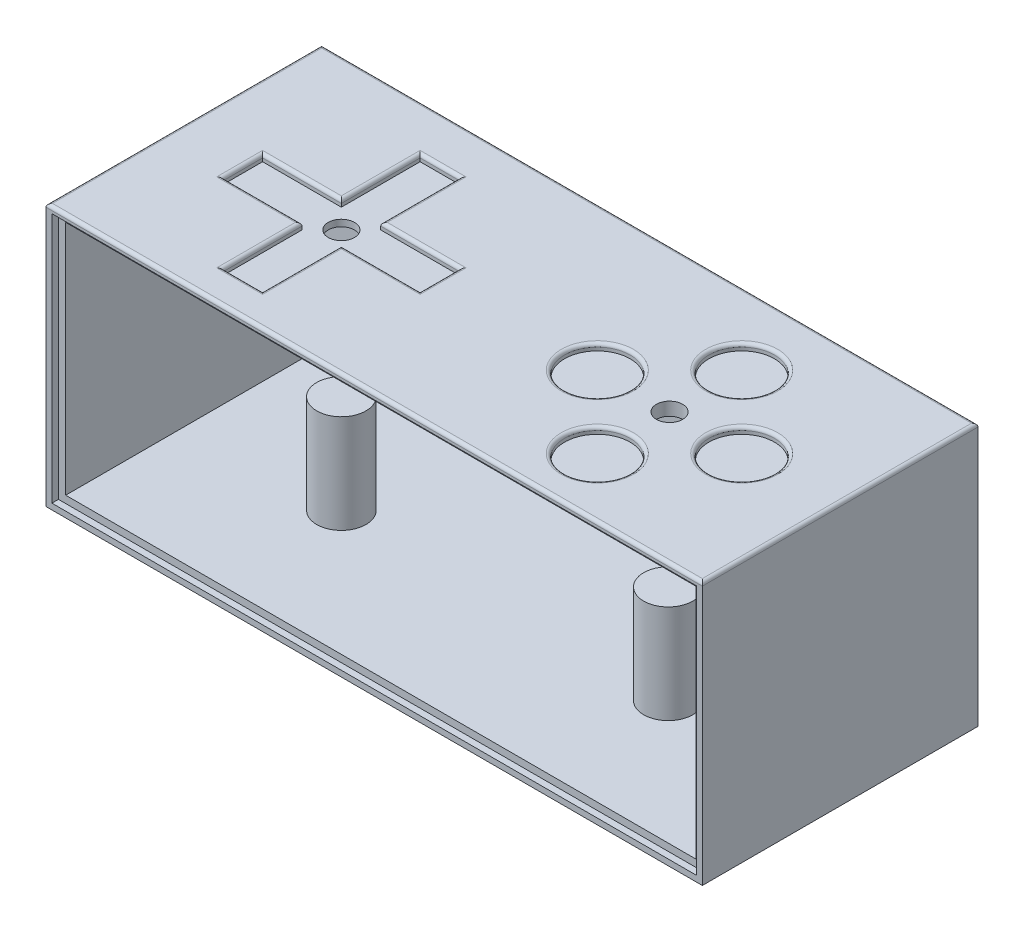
ISO-10303-21;
HEADER;
FILE_DESCRIPTION(('STEP AP214'),'2;1');
FILE_NAME('part.step','',(''),(''),'','','');
FILE_SCHEMA(('AUTOMOTIVE_DESIGN { 1 0 10303 214 1 1 1 1 }'));
ENDSEC;
DATA;
#1=APPLICATION_CONTEXT('core data for automotive mechanical design processes');
#2=APPLICATION_PROTOCOL_DEFINITION('international standard','automotive_design',2000,#1);
#3=PRODUCT_CONTEXT('',#1,'mechanical');
#4=PRODUCT('Part','Part','',(#3));
#5=PRODUCT_RELATED_PRODUCT_CATEGORY('part','',(#4));
#6=PRODUCT_DEFINITION_FORMATION('','',#4);
#7=PRODUCT_DEFINITION_CONTEXT('part definition',#1,'design');
#8=PRODUCT_DEFINITION('design','',#6,#7);
#9=PRODUCT_DEFINITION_SHAPE('','',#8);
#10=(LENGTH_UNIT() NAMED_UNIT(*) SI_UNIT(.MILLI.,.METRE.));
#11=(NAMED_UNIT(*) PLANE_ANGLE_UNIT() SI_UNIT($,.RADIAN.));
#12=(NAMED_UNIT(*) SI_UNIT($,.STERADIAN.) SOLID_ANGLE_UNIT());
#13=UNCERTAINTY_MEASURE_WITH_UNIT(LENGTH_MEASURE(1.E-05),#10,'distance_accuracy_value','');
#14=(GEOMETRIC_REPRESENTATION_CONTEXT(3) GLOBAL_UNCERTAINTY_ASSIGNED_CONTEXT((#13)) GLOBAL_UNIT_ASSIGNED_CONTEXT((#10,
#11,#12)) REPRESENTATION_CONTEXT('',''));
#15=CARTESIAN_POINT('',(0.,0.,0.));
#16=DIRECTION('',(0.,0.,1.));
#17=DIRECTION('',(1.,0.,0.));
#18=AXIS2_PLACEMENT_3D('',#15,#16,#17);
#19=CARTESIAN_POINT('',(-100.,40.,4.));
#20=DIRECTION('',(0.,-1.,0.));
#21=DIRECTION('',(0.,0.,-1.));
#22=AXIS2_PLACEMENT_3D('',#19,#20,#21);
#23=PLANE('',#22);
#24=CARTESIAN_POINT('',(50.,40.,44.));
#25=DIRECTION('',(0.,1.,0.));
#26=DIRECTION('',(0.,0.,1.));
#27=AXIS2_PLACEMENT_3D('',#24,#25,#26);
#28=CIRCLE('',#27,4.00000000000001);
#29=CARTESIAN_POINT('',(50.,40.,48.));
#30=VERTEX_POINT('',#29);
#31=EDGE_CURVE('E859',#30,#30,#28,.T.);
#32=ORIENTED_EDGE('',*,*,#31,.F.);
#33=EDGE_LOOP('',(#32));
#34=FACE_BOUND('',#33,.T.);
#35=DIRECTION('',(0.,0.,-1.));
#36=VECTOR('',#35,1.);
#37=CARTESIAN_POINT('',(-43.,40.,4.));
#38=LINE('',#37,#36);
#39=CARTESIAN_POINT('',(-43.,40.,51.));
#40=VERTEX_POINT('',#39);
#41=CARTESIAN_POINT('',(-43.,40.,75.));
#42=VERTEX_POINT('',#41);
#43=EDGE_CURVE('E500',#40,#42,#38,.F.);
#44=ORIENTED_EDGE('',*,*,#43,.T.);
#45=DIRECTION('',(1.,0.,0.));
#46=VECTOR('',#45,1.);
#47=CARTESIAN_POINT('',(-100.,40.,75.));
#48=LINE('',#47,#46);
#49=CARTESIAN_POINT('',(-57.,40.,75.));
#50=VERTEX_POINT('',#49);
#51=EDGE_CURVE('E502',#42,#50,#48,.F.);
#52=ORIENTED_EDGE('',*,*,#51,.T.);
#53=DIRECTION('',(0.,0.,-1.));
#54=VECTOR('',#53,1.);
#55=CARTESIAN_POINT('',(-57.,40.,50.));
#56=LINE('',#55,#54);
#57=CARTESIAN_POINT('',(-57.,40.,51.));
#58=VERTEX_POINT('',#57);
#59=EDGE_CURVE('E480',#50,#58,#56,.T.);
#60=ORIENTED_EDGE('',*,*,#59,.T.);
#61=DIRECTION('',(1.,0.,0.));
#62=VECTOR('',#61,1.);
#63=CARTESIAN_POINT('',(-100.,40.,51.));
#64=LINE('',#63,#62);
#65=CARTESIAN_POINT('',(-81.,40.,51.));
#66=VERTEX_POINT('',#65);
#67=EDGE_CURVE('E482',#58,#66,#64,.F.);
#68=ORIENTED_EDGE('',*,*,#67,.T.);
#69=DIRECTION('',(0.,0.,-1.));
#70=VECTOR('',#69,1.);
#71=CARTESIAN_POINT('',(-81.,40.,38.));
#72=LINE('',#71,#70);
#73=CARTESIAN_POINT('',(-81.,40.,37.));
#74=VERTEX_POINT('',#73);
#75=EDGE_CURVE('E484',#66,#74,#72,.T.);
#76=ORIENTED_EDGE('',*,*,#75,.T.);
#77=DIRECTION('',(1.,0.,0.));
#78=VECTOR('',#77,1.);
#79=CARTESIAN_POINT('',(-56.,40.,37.));
#80=LINE('',#79,#78);
#81=CARTESIAN_POINT('',(-57.,40.,37.));
#82=VERTEX_POINT('',#81);
#83=EDGE_CURVE('E486',#74,#82,#80,.T.);
#84=ORIENTED_EDGE('',*,*,#83,.T.);
#85=DIRECTION('',(0.,0.,-1.));
#86=VECTOR('',#85,1.);
#87=CARTESIAN_POINT('',(-57.,40.,14.));
#88=LINE('',#87,#86);
#89=CARTESIAN_POINT('',(-57.,40.,13.));
#90=VERTEX_POINT('',#89);
#91=EDGE_CURVE('E488',#82,#90,#88,.T.);
#92=ORIENTED_EDGE('',*,*,#91,.T.);
#93=DIRECTION('',(1.,0.,0.));
#94=VECTOR('',#93,1.);
#95=CARTESIAN_POINT('',(-44.,40.,13.));
#96=LINE('',#95,#94);
#97=CARTESIAN_POINT('',(-43.,40.,13.));
#98=VERTEX_POINT('',#97);
#99=EDGE_CURVE('E490',#90,#98,#96,.T.);
#100=ORIENTED_EDGE('',*,*,#99,.T.);
#101=DIRECTION('',(0.,0.,-1.));
#102=VECTOR('',#101,1.);
#103=CARTESIAN_POINT('',(-43.,40.,4.));
#104=LINE('',#103,#102);
#105=CARTESIAN_POINT('',(-43.,40.,37.));
#106=VERTEX_POINT('',#105);
#107=EDGE_CURVE('E492',#98,#106,#104,.F.);
#108=ORIENTED_EDGE('',*,*,#107,.T.);
#109=DIRECTION('',(1.,0.,0.));
#110=VECTOR('',#109,1.);
#111=CARTESIAN_POINT('',(-20.,40.,37.));
#112=LINE('',#111,#110);
#113=CARTESIAN_POINT('',(-19.,40.,37.));
#114=VERTEX_POINT('',#113);
#115=EDGE_CURVE('E494',#106,#114,#112,.T.);
#116=ORIENTED_EDGE('',*,*,#115,.T.);
#117=DIRECTION('',(0.,0.,-1.));
#118=VECTOR('',#117,1.);
#119=CARTESIAN_POINT('',(-19.,40.,4.));
#120=LINE('',#119,#118);
#121=CARTESIAN_POINT('',(-19.,40.,51.));
#122=VERTEX_POINT('',#121);
#123=EDGE_CURVE('E496',#114,#122,#120,.F.);
#124=ORIENTED_EDGE('',*,*,#123,.T.);
#125=DIRECTION('',(1.,0.,0.));
#126=VECTOR('',#125,1.);
#127=CARTESIAN_POINT('',(-100.,40.,51.));
#128=LINE('',#127,#126);
#129=EDGE_CURVE('E498',#122,#40,#128,.F.);
#130=ORIENTED_EDGE('',*,*,#129,.T.);
#131=EDGE_LOOP('',(#44,#52,#60,#68,#76,#84,#92,#100,#108,#116,#124,#130));
#132=FACE_BOUND('',#131,.T.);
#133=CARTESIAN_POINT('',(50.,40.,22.));
#134=DIRECTION('',(0.,-1.,0.));
#135=DIRECTION('',(0.,0.,-1.));
#136=AXIS2_PLACEMENT_3D('',#133,#134,#135);
#137=CIRCLE('',#136,11.);
#138=CARTESIAN_POINT('',(50.,40.,11.));
#139=VERTEX_POINT('',#138);
#140=EDGE_CURVE('E477',#139,#139,#137,.T.);
#141=ORIENTED_EDGE('',*,*,#140,.T.);
#142=EDGE_LOOP('',(#141));
#143=FACE_BOUND('',#142,.T.);
#144=DIRECTION('',(1.,0.,0.));
#145=VECTOR('',#144,1.);
#146=CARTESIAN_POINT('',(100.,40.,83.));
#147=LINE('',#146,#145);
#148=CARTESIAN_POINT('',(-99.,40.,83.));
#149=VERTEX_POINT('',#148);
#150=CARTESIAN_POINT('',(99.,40.,83.));
#151=VERTEX_POINT('',#150);
#152=EDGE_CURVE('E472',#149,#151,#147,.T.);
#153=ORIENTED_EDGE('',*,*,#152,.T.);
#154=DIRECTION('',(0.,0.,-1.));
#155=VECTOR('',#154,1.);
#156=CARTESIAN_POINT('',(99.,40.,4.));
#157=LINE('',#156,#155);
#158=CARTESIAN_POINT('',(99.,40.,1.));
#159=VERTEX_POINT('',#158);
#160=EDGE_CURVE('E474',#151,#159,#157,.T.);
#161=ORIENTED_EDGE('',*,*,#160,.T.);
#162=DIRECTION('',(-1.,0.,0.));
#163=VECTOR('',#162,1.);
#164=CARTESIAN_POINT('',(-100.,40.,1.));
#165=LINE('',#164,#163);
#166=CARTESIAN_POINT('',(-99.,40.,1.));
#167=VERTEX_POINT('',#166);
#168=EDGE_CURVE('E468',#159,#167,#165,.T.);
#169=ORIENTED_EDGE('',*,*,#168,.T.);
#170=DIRECTION('',(0.,0.,-1.));
#171=VECTOR('',#170,1.);
#172=CARTESIAN_POINT('',(-99.,40.,4.));
#173=LINE('',#172,#171);
#174=EDGE_CURVE('E470',#167,#149,#173,.F.);
#175=ORIENTED_EDGE('',*,*,#174,.T.);
#176=EDGE_LOOP('',(#153,#161,#169,#175));
#177=FACE_BOUND('',#176,.T.);
#178=CARTESIAN_POINT('',(50.,40.,66.0000000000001));
#179=DIRECTION('',(0.,-1.,0.));
#180=DIRECTION('',(0.,0.,-1.));
#181=AXIS2_PLACEMENT_3D('',#178,#179,#180);
#182=CIRCLE('',#181,11.);
#183=CARTESIAN_POINT('',(50.,40.,55.0000000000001));
#184=VERTEX_POINT('',#183);
#185=EDGE_CURVE('E465',#184,#184,#182,.T.);
#186=ORIENTED_EDGE('',*,*,#185,.T.);
#187=EDGE_LOOP('',(#186));
#188=FACE_BOUND('',#187,.T.);
#189=CARTESIAN_POINT('',(28.,40.,44.));
#190=DIRECTION('',(0.,-1.,0.));
#191=DIRECTION('',(0.,0.,-1.));
#192=AXIS2_PLACEMENT_3D('',#189,#190,#191);
#193=CIRCLE('',#192,11.);
#194=CARTESIAN_POINT('',(28.,40.,33.));
#195=VERTEX_POINT('',#194);
#196=EDGE_CURVE('E462',#195,#195,#193,.T.);
#197=ORIENTED_EDGE('',*,*,#196,.T.);
#198=EDGE_LOOP('',(#197));
#199=FACE_BOUND('',#198,.T.);
#200=CARTESIAN_POINT('',(72.,40.,44.));
#201=DIRECTION('',(0.,-1.,0.));
#202=DIRECTION('',(0.,0.,-1.));
#203=AXIS2_PLACEMENT_3D('',#200,#201,#202);
#204=CIRCLE('',#203,11.);
#205=CARTESIAN_POINT('',(72.,40.,33.));
#206=VERTEX_POINT('',#205);
#207=EDGE_CURVE('E459',#206,#206,#204,.T.);
#208=ORIENTED_EDGE('',*,*,#207,.T.);
#209=EDGE_LOOP('',(#208));
#210=FACE_BOUND('',#209,.T.);
#211=ADVANCED_FACE('F63',(#34,#132,#143,#177,#188,#199,#210),#23,.F.);
#212=CARTESIAN_POINT('',(100.,-40.,4.));
#213=DIRECTION('',(-1.,0.,0.));
#214=DIRECTION('',(0.,0.,1.));
#215=AXIS2_PLACEMENT_3D('',#212,#213,#214);
#216=PLANE('',#215);
#217=DIRECTION('',(0.,1.,0.));
#218=VECTOR('',#217,1.);
#219=CARTESIAN_POINT('',(100.,-40.,0.));
#220=LINE('',#219,#218);
#221=CARTESIAN_POINT('',(100.,-40.,0.));
#222=VERTEX_POINT('',#221);
#223=CARTESIAN_POINT('',(100.,39.,0.));
#224=VERTEX_POINT('',#223);
#225=EDGE_CURVE('E441',#222,#224,#220,.T.);
#226=ORIENTED_EDGE('',*,*,#225,.T.);
#227=DIRECTION('',(0.,0.,-1.));
#228=VECTOR('',#227,1.);
#229=CARTESIAN_POINT('',(100.,39.,4.));
#230=LINE('',#229,#228);
#231=CARTESIAN_POINT('',(100.,39.,84.));
#232=VERTEX_POINT('',#231);
#233=EDGE_CURVE('E529',#224,#232,#230,.F.);
#234=ORIENTED_EDGE('',*,*,#233,.T.);
#235=DIRECTION('',(0.,1.,0.));
#236=VECTOR('',#235,1.);
#237=CARTESIAN_POINT('',(100.,-40.,84.));
#238=LINE('',#237,#236);
#239=CARTESIAN_POINT('',(100.,-40.,84.));
#240=VERTEX_POINT('',#239);
#241=EDGE_CURVE('E427',#240,#232,#238,.T.);
#242=ORIENTED_EDGE('',*,*,#241,.F.);
#243=DIRECTION('',(0.,0.,-1.));
#244=VECTOR('',#243,1.);
#245=CARTESIAN_POINT('',(100.,-40.,4.));
#246=LINE('',#245,#244);
#247=EDGE_CURVE('E448',#240,#222,#246,.T.);
#248=ORIENTED_EDGE('',*,*,#247,.T.);
#249=EDGE_LOOP('',(#226,#234,#242,#248));
#250=FACE_BOUND('',#249,.T.);
#251=ADVANCED_FACE('F641',(#250),#216,.F.);
#252=CARTESIAN_POINT('',(-100.,-40.,4.));
#253=DIRECTION('',(1.,0.,0.));
#254=DIRECTION('',(0.,0.,-1.));
#255=AXIS2_PLACEMENT_3D('',#252,#253,#254);
#256=PLANE('',#255);
#257=DIRECTION('',(0.,1.,0.));
#258=VECTOR('',#257,1.);
#259=CARTESIAN_POINT('',(-100.,-40.,84.));
#260=LINE('',#259,#258);
#261=CARTESIAN_POINT('',(-100.,-40.,84.));
#262=VERTEX_POINT('',#261);
#263=CARTESIAN_POINT('',(-100.,39.,84.));
#264=VERTEX_POINT('',#263);
#265=EDGE_CURVE('E439',#262,#264,#260,.T.);
#266=ORIENTED_EDGE('',*,*,#265,.T.);
#267=DIRECTION('',(0.,0.,-1.));
#268=VECTOR('',#267,1.);
#269=CARTESIAN_POINT('',(-100.,39.,4.));
#270=LINE('',#269,#268);
#271=CARTESIAN_POINT('',(-100.,39.,0.));
#272=VERTEX_POINT('',#271);
#273=EDGE_CURVE('E83',#264,#272,#270,.T.);
#274=ORIENTED_EDGE('',*,*,#273,.T.);
#275=DIRECTION('',(0.,-1.,0.));
#276=VECTOR('',#275,1.);
#277=CARTESIAN_POINT('',(-100.,-40.,0.));
#278=LINE('',#277,#276);
#279=CARTESIAN_POINT('',(-100.,-40.,0.));
#280=VERTEX_POINT('',#279);
#281=EDGE_CURVE('E444',#272,#280,#278,.T.);
#282=ORIENTED_EDGE('',*,*,#281,.T.);
#283=DIRECTION('',(0.,0.,-1.));
#284=VECTOR('',#283,1.);
#285=CARTESIAN_POINT('',(-100.,-40.,4.));
#286=LINE('',#285,#284);
#287=EDGE_CURVE('E451',#262,#280,#286,.T.);
#288=ORIENTED_EDGE('',*,*,#287,.F.);
#289=EDGE_LOOP('',(#266,#274,#282,#288));
#290=FACE_BOUND('',#289,.T.);
#291=ADVANCED_FACE('F647',(#290),#256,.F.);
#292=CARTESIAN_POINT('',(-100.,-40.,4.));
#293=DIRECTION('',(0.,1.,0.));
#294=DIRECTION('',(0.,0.,1.));
#295=AXIS2_PLACEMENT_3D('',#292,#293,#294);
#296=PLANE('',#295);
#297=DIRECTION('',(1.,0.,0.));
#298=VECTOR('',#297,1.);
#299=CARTESIAN_POINT('',(-100.,-40.,0.));
#300=LINE('',#299,#298);
#301=EDGE_CURVE('E446',#280,#222,#300,.T.);
#302=ORIENTED_EDGE('',*,*,#301,.T.);
#303=ORIENTED_EDGE('',*,*,#247,.F.);
#304=DIRECTION('',(1.,0.,0.));
#305=VECTOR('',#304,1.);
#306=CARTESIAN_POINT('',(-100.,-40.,84.));
#307=LINE('',#306,#305);
#308=EDGE_CURVE('E436',#262,#240,#307,.T.);
#309=ORIENTED_EDGE('',*,*,#308,.F.);
#310=ORIENTED_EDGE('',*,*,#287,.T.);
#311=EDGE_LOOP('',(#302,#303,#309,#310));
#312=FACE_BOUND('',#311,.T.);
#313=ADVANCED_FACE('F883',(#312),#296,.F.);
#314=CARTESIAN_POINT('',(0.,0.,0.));
#315=DIRECTION('',(0.,0.,-1.));
#316=DIRECTION('',(-1.,0.,0.));
#317=AXIS2_PLACEMENT_3D('',#314,#315,#316);
#318=PLANE('',#317);
#319=CARTESIAN_POINT('',(0.,-30.,0.));
#320=DIRECTION('',(0.,0.,-1.));
#321=DIRECTION('',(-1.,0.,0.));
#322=AXIS2_PLACEMENT_3D('',#319,#320,#321);
#323=CIRCLE('',#322,6.);
#324=CARTESIAN_POINT('',(-6.,-30.,0.));
#325=VERTEX_POINT('',#324);
#326=EDGE_CURVE('E853',#325,#325,#323,.T.);
#327=ORIENTED_EDGE('',*,*,#326,.F.);
#328=EDGE_LOOP('',(#327));
#329=FACE_BOUND('',#328,.T.);
#330=ORIENTED_EDGE('',*,*,#281,.F.);
#331=DIRECTION('',(-1.,0.,0.));
#332=VECTOR('',#331,1.);
#333=CARTESIAN_POINT('',(100.,39.,0.));
#334=LINE('',#333,#332);
#335=EDGE_CURVE('E535',#272,#224,#334,.F.);
#336=ORIENTED_EDGE('',*,*,#335,.T.);
#337=ORIENTED_EDGE('',*,*,#225,.F.);
#338=ORIENTED_EDGE('',*,*,#301,.F.);
#339=EDGE_LOOP('',(#330,#336,#337,#338));
#340=FACE_BOUND('',#339,.T.);
#341=ADVANCED_FACE('F635',(#329,#340),#318,.T.);
#342=CARTESIAN_POINT('',(0.,0.,84.));
#343=DIRECTION('',(0.,0.,1.));
#344=DIRECTION('',(1.,0.,0.));
#345=AXIS2_PLACEMENT_3D('',#342,#343,#344);
#346=PLANE('',#345);
#347=DIRECTION('',(0.,1.,0.));
#348=VECTOR('',#347,1.);
#349=CARTESIAN_POINT('',(98.2,-38.2,84.));
#350=LINE('',#349,#348);
#351=CARTESIAN_POINT('',(98.2,-38.2,84.));
#352=VERTEX_POINT('',#351);
#353=CARTESIAN_POINT('',(98.2,38.2,84.));
#354=VERTEX_POINT('',#353);
#355=EDGE_CURVE('E334',#352,#354,#350,.T.);
#356=ORIENTED_EDGE('',*,*,#355,.F.);
#357=DIRECTION('',(1.,0.,0.));
#358=VECTOR('',#357,1.);
#359=CARTESIAN_POINT('',(-98.2,-38.2,84.));
#360=LINE('',#359,#358);
#361=CARTESIAN_POINT('',(-98.2,-38.2,84.));
#362=VERTEX_POINT('',#361);
#363=EDGE_CURVE('E376',#362,#352,#360,.T.);
#364=ORIENTED_EDGE('',*,*,#363,.F.);
#365=DIRECTION('',(0.,-1.,0.));
#366=VECTOR('',#365,1.);
#367=CARTESIAN_POINT('',(-98.2,-38.2,84.));
#368=LINE('',#367,#366);
#369=CARTESIAN_POINT('',(-98.2,38.2,84.));
#370=VERTEX_POINT('',#369);
#371=EDGE_CURVE('E390',#370,#362,#368,.T.);
#372=ORIENTED_EDGE('',*,*,#371,.F.);
#373=DIRECTION('',(-1.,0.,0.));
#374=VECTOR('',#373,1.);
#375=CARTESIAN_POINT('',(-98.2,38.2,84.));
#376=LINE('',#375,#374);
#377=EDGE_CURVE('E387',#354,#370,#376,.T.);
#378=ORIENTED_EDGE('',*,*,#377,.F.);
#379=EDGE_LOOP('',(#356,#364,#372,#378));
#380=FACE_BOUND('',#379,.T.);
#381=ORIENTED_EDGE('',*,*,#241,.T.);
#382=DIRECTION('',(1.,0.,0.));
#383=VECTOR('',#382,1.);
#384=CARTESIAN_POINT('',(-100.,39.,84.));
#385=LINE('',#384,#383);
#386=EDGE_CURVE('E532',#232,#264,#385,.F.);
#387=ORIENTED_EDGE('',*,*,#386,.T.);
#388=ORIENTED_EDGE('',*,*,#265,.F.);
#389=ORIENTED_EDGE('',*,*,#308,.T.);
#390=EDGE_LOOP('',(#381,#387,#388,#389));
#391=FACE_BOUND('',#390,.T.);
#392=ADVANCED_FACE('F625',(#380,#391),#346,.T.);
#393=CARTESIAN_POINT('',(0.,0.,82.));
#394=DIRECTION('',(0.,0.,-1.));
#395=DIRECTION('',(-1.,0.,0.));
#396=AXIS2_PLACEMENT_3D('',#393,#394,#395);
#397=PLANE('',#396);
#398=DIRECTION('',(0.,1.,0.));
#399=VECTOR('',#398,1.);
#400=CARTESIAN_POINT('',(98.2,-38.2,82.));
#401=LINE('',#400,#399);
#402=CARTESIAN_POINT('',(98.2,-38.2,82.));
#403=VERTEX_POINT('',#402);
#404=CARTESIAN_POINT('',(98.2,38.2,82.));
#405=VERTEX_POINT('',#404);
#406=EDGE_CURVE('E372',#403,#405,#401,.T.);
#407=ORIENTED_EDGE('',*,*,#406,.T.);
#408=DIRECTION('',(-1.,0.,0.));
#409=VECTOR('',#408,1.);
#410=CARTESIAN_POINT('',(-98.2,38.2,82.));
#411=LINE('',#410,#409);
#412=CARTESIAN_POINT('',(-98.2,38.2,82.));
#413=VERTEX_POINT('',#412);
#414=EDGE_CURVE('E375',#405,#413,#411,.T.);
#415=ORIENTED_EDGE('',*,*,#414,.T.);
#416=DIRECTION('',(0.,-1.,0.));
#417=VECTOR('',#416,1.);
#418=CARTESIAN_POINT('',(-98.2,-38.2,82.));
#419=LINE('',#418,#417);
#420=CARTESIAN_POINT('',(-98.2,-38.2,82.));
#421=VERTEX_POINT('',#420);
#422=EDGE_CURVE('E379',#413,#421,#419,.T.);
#423=ORIENTED_EDGE('',*,*,#422,.T.);
#424=DIRECTION('',(1.,0.,0.));
#425=VECTOR('',#424,1.);
#426=CARTESIAN_POINT('',(-98.2,-38.2,82.));
#427=LINE('',#426,#425);
#428=EDGE_CURVE('E382',#421,#403,#427,.T.);
#429=ORIENTED_EDGE('',*,*,#428,.T.);
#430=EDGE_LOOP('',(#407,#415,#423,#429));
#431=FACE_BOUND('',#430,.T.);
#432=DIRECTION('',(0.,-1.,0.));
#433=VECTOR('',#432,1.);
#434=CARTESIAN_POINT('',(96.,-36.,82.));
#435=LINE('',#434,#433);
#436=CARTESIAN_POINT('',(96.,36.,82.));
#437=VERTEX_POINT('',#436);
#438=CARTESIAN_POINT('',(96.,-36.,82.));
#439=VERTEX_POINT('',#438);
#440=EDGE_CURVE('E454',#437,#439,#435,.T.);
#441=ORIENTED_EDGE('',*,*,#440,.T.);
#442=DIRECTION('',(-1.,0.,0.));
#443=VECTOR('',#442,1.);
#444=CARTESIAN_POINT('',(-96.,-36.,82.));
#445=LINE('',#444,#443);
#446=CARTESIAN_POINT('',(-96.,-36.,82.));
#447=VERTEX_POINT('',#446);
#448=EDGE_CURVE('E397',#439,#447,#445,.T.);
#449=ORIENTED_EDGE('',*,*,#448,.T.);
#450=DIRECTION('',(0.,-1.,0.));
#451=VECTOR('',#450,1.);
#452=CARTESIAN_POINT('',(-96.,-36.,82.));
#453=LINE('',#452,#451);
#454=CARTESIAN_POINT('',(-96.,36.,82.));
#455=VERTEX_POINT('',#454);
#456=EDGE_CURVE('E405',#455,#447,#453,.T.);
#457=ORIENTED_EDGE('',*,*,#456,.F.);
#458=DIRECTION('',(-1.,0.,0.));
#459=VECTOR('',#458,1.);
#460=CARTESIAN_POINT('',(-96.,36.,82.));
#461=LINE('',#460,#459);
#462=EDGE_CURVE('E408',#437,#455,#461,.T.);
#463=ORIENTED_EDGE('',*,*,#462,.F.);
#464=EDGE_LOOP('',(#441,#449,#457,#463));
#465=FACE_BOUND('',#464,.T.);
#466=ADVANCED_FACE('F622',(#431,#465),#397,.F.);
#467=CARTESIAN_POINT('',(98.2,-38.2,82.));
#468=DIRECTION('',(1.,0.,0.));
#469=DIRECTION('',(0.,0.,-1.));
#470=AXIS2_PLACEMENT_3D('',#467,#468,#469);
#471=PLANE('',#470);
#472=ORIENTED_EDGE('',*,*,#355,.T.);
#473=DIRECTION('',(0.,0.,1.));
#474=VECTOR('',#473,1.);
#475=CARTESIAN_POINT('',(98.2,38.2,82.));
#476=LINE('',#475,#474);
#477=EDGE_CURVE('E385',#405,#354,#476,.T.);
#478=ORIENTED_EDGE('',*,*,#477,.F.);
#479=ORIENTED_EDGE('',*,*,#406,.F.);
#480=DIRECTION('',(0.,0.,1.));
#481=VECTOR('',#480,1.);
#482=CARTESIAN_POINT('',(98.2,-38.2,82.));
#483=LINE('',#482,#481);
#484=EDGE_CURVE('E395',#403,#352,#483,.T.);
#485=ORIENTED_EDGE('',*,*,#484,.T.);
#486=EDGE_LOOP('',(#472,#478,#479,#485));
#487=FACE_BOUND('',#486,.T.);
#488=ADVANCED_FACE('F624',(#487),#471,.F.);
#489=CARTESIAN_POINT('',(-98.2,-38.2,82.));
#490=DIRECTION('',(0.,-1.,0.));
#491=DIRECTION('',(0.,0.,-1.));
#492=AXIS2_PLACEMENT_3D('',#489,#490,#491);
#493=PLANE('',#492);
#494=ORIENTED_EDGE('',*,*,#363,.T.);
#495=ORIENTED_EDGE('',*,*,#484,.F.);
#496=ORIENTED_EDGE('',*,*,#428,.F.);
#497=DIRECTION('',(0.,0.,1.));
#498=VECTOR('',#497,1.);
#499=CARTESIAN_POINT('',(-98.2,-38.2,82.));
#500=LINE('',#499,#498);
#501=EDGE_CURVE('E398',#421,#362,#500,.T.);
#502=ORIENTED_EDGE('',*,*,#501,.T.);
#503=EDGE_LOOP('',(#494,#495,#496,#502));
#504=FACE_BOUND('',#503,.T.);
#505=ADVANCED_FACE('F632',(#504),#493,.F.);
#506=CARTESIAN_POINT('',(-98.2,-38.2,82.));
#507=DIRECTION('',(-1.,0.,0.));
#508=DIRECTION('',(0.,0.,1.));
#509=AXIS2_PLACEMENT_3D('',#506,#507,#508);
#510=PLANE('',#509);
#511=ORIENTED_EDGE('',*,*,#371,.T.);
#512=ORIENTED_EDGE('',*,*,#501,.F.);
#513=ORIENTED_EDGE('',*,*,#422,.F.);
#514=DIRECTION('',(0.,0.,1.));
#515=VECTOR('',#514,1.);
#516=CARTESIAN_POINT('',(-98.2,38.2,82.));
#517=LINE('',#516,#515);
#518=EDGE_CURVE('E400',#413,#370,#517,.T.);
#519=ORIENTED_EDGE('',*,*,#518,.T.);
#520=EDGE_LOOP('',(#511,#512,#513,#519));
#521=FACE_BOUND('',#520,.T.);
#522=ADVANCED_FACE('F992',(#521),#510,.F.);
#523=CARTESIAN_POINT('',(-98.2,38.2,82.));
#524=DIRECTION('',(0.,1.,0.));
#525=DIRECTION('',(0.,0.,1.));
#526=AXIS2_PLACEMENT_3D('',#523,#524,#525);
#527=PLANE('',#526);
#528=ORIENTED_EDGE('',*,*,#377,.T.);
#529=ORIENTED_EDGE('',*,*,#518,.F.);
#530=ORIENTED_EDGE('',*,*,#414,.F.);
#531=ORIENTED_EDGE('',*,*,#477,.T.);
#532=EDGE_LOOP('',(#528,#529,#530,#531));
#533=FACE_BOUND('',#532,.T.);
#534=ADVANCED_FACE('F881',(#533),#527,.F.);
#535=CARTESIAN_POINT('',(0.,0.,4.));
#536=DIRECTION('',(0.,0.,-1.));
#537=DIRECTION('',(-1.,0.,0.));
#538=AXIS2_PLACEMENT_3D('',#535,#536,#537);
#539=PLANE('',#538);
#540=DIRECTION('',(1.,0.,0.));
#541=VECTOR('',#540,1.);
#542=CARTESIAN_POINT('',(-96.,-36.,4.));
#543=LINE('',#542,#541);
#544=CARTESIAN_POINT('',(-96.,-36.,4.));
#545=VERTEX_POINT('',#544);
#546=CARTESIAN_POINT('',(0.,-36.,4.));
#547=VERTEX_POINT('',#546);
#548=EDGE_CURVE('E418',#545,#547,#543,.T.);
#549=ORIENTED_EDGE('',*,*,#548,.T.);
#550=CARTESIAN_POINT('',(0.,-30.,4.));
#551=DIRECTION('',(0.,0.,-1.));
#552=DIRECTION('',(-1.,0.,0.));
#553=AXIS2_PLACEMENT_3D('',#550,#551,#552);
#554=CIRCLE('',#553,6.);
#555=EDGE_CURVE('E76',#547,#547,#554,.T.);
#556=ORIENTED_EDGE('',*,*,#555,.T.);
#557=CARTESIAN_POINT('',(96.,-36.,4.));
#558=VERTEX_POINT('',#557);
#559=EDGE_CURVE('E417',#547,#558,#543,.T.);
#560=ORIENTED_EDGE('',*,*,#559,.T.);
#561=DIRECTION('',(0.,1.,0.));
#562=VECTOR('',#561,1.);
#563=CARTESIAN_POINT('',(96.,-36.,4.));
#564=LINE('',#563,#562);
#565=CARTESIAN_POINT('',(96.,36.,4.));
#566=VERTEX_POINT('',#565);
#567=EDGE_CURVE('E414',#558,#566,#564,.T.);
#568=ORIENTED_EDGE('',*,*,#567,.T.);
#569=DIRECTION('',(1.,0.,0.));
#570=VECTOR('',#569,1.);
#571=CARTESIAN_POINT('',(-96.,36.,4.));
#572=LINE('',#571,#570);
#573=CARTESIAN_POINT('',(-96.,36.,4.));
#574=VERTEX_POINT('',#573);
#575=EDGE_CURVE('E411',#574,#566,#572,.T.);
#576=ORIENTED_EDGE('',*,*,#575,.F.);
#577=DIRECTION('',(0.,1.,0.));
#578=VECTOR('',#577,1.);
#579=CARTESIAN_POINT('',(-96.,-36.,4.));
#580=LINE('',#579,#578);
#581=EDGE_CURVE('E421',#545,#574,#580,.T.);
#582=ORIENTED_EDGE('',*,*,#581,.F.);
#583=EDGE_LOOP('',(#549,#556,#560,#568,#576,#582));
#584=FACE_BOUND('',#583,.T.);
#585=ADVANCED_FACE('F612',(#584),#539,.F.);
#586=CARTESIAN_POINT('',(96.,-36.,84.));
#587=DIRECTION('',(-1.,0.,0.));
#588=DIRECTION('',(0.,0.,1.));
#589=AXIS2_PLACEMENT_3D('',#586,#587,#588);
#590=PLANE('',#589);
#591=ORIENTED_EDGE('',*,*,#440,.F.);
#592=DIRECTION('',(0.,0.,-1.));
#593=VECTOR('',#592,1.);
#594=CARTESIAN_POINT('',(96.,36.,84.));
#595=LINE('',#594,#593);
#596=EDGE_CURVE('E424',#437,#566,#595,.T.);
#597=ORIENTED_EDGE('',*,*,#596,.T.);
#598=ORIENTED_EDGE('',*,*,#567,.F.);
#599=DIRECTION('',(0.,0.,-1.));
#600=VECTOR('',#599,1.);
#601=CARTESIAN_POINT('',(96.,-36.,84.));
#602=LINE('',#601,#600);
#603=EDGE_CURVE('E430',#439,#558,#602,.T.);
#604=ORIENTED_EDGE('',*,*,#603,.F.);
#605=EDGE_LOOP('',(#591,#597,#598,#604));
#606=FACE_BOUND('',#605,.T.);
#607=ADVANCED_FACE('F601',(#606),#590,.T.);
#608=CARTESIAN_POINT('',(-96.,-36.,84.));
#609=DIRECTION('',(0.,1.,0.));
#610=DIRECTION('',(0.,0.,1.));
#611=AXIS2_PLACEMENT_3D('',#608,#609,#610);
#612=PLANE('',#611);
#613=CARTESIAN_POINT('',(50.,-36.,44.3831013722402));
#614=DIRECTION('',(0.,1.,0.));
#615=DIRECTION('',(0.,0.,1.));
#616=AXIS2_PLACEMENT_3D('',#613,#614,#615);
#617=CIRCLE('',#616,7.5);
#618=CARTESIAN_POINT('',(50.,-36.,51.8831013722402));
#619=VERTEX_POINT('',#618);
#620=EDGE_CURVE('E12',#619,#619,#617,.T.);
#621=ORIENTED_EDGE('',*,*,#620,.F.);
#622=EDGE_LOOP('',(#621));
#623=FACE_BOUND('',#622,.T.);
#624=CARTESIAN_POINT('',(-50.,-36.,44.));
#625=DIRECTION('',(0.,1.,0.));
#626=DIRECTION('',(0.,0.,1.));
#627=AXIS2_PLACEMENT_3D('',#624,#625,#626);
#628=CIRCLE('',#627,7.5);
#629=CARTESIAN_POINT('',(-50.,-36.,51.5));
#630=VERTEX_POINT('',#629);
#631=EDGE_CURVE('E71',#630,#630,#628,.T.);
#632=ORIENTED_EDGE('',*,*,#631,.F.);
#633=EDGE_LOOP('',(#632));
#634=FACE_BOUND('',#633,.T.);
#635=ORIENTED_EDGE('',*,*,#559,.F.);
#636=ORIENTED_EDGE('',*,*,#548,.F.);
#637=DIRECTION('',(0.,0.,-1.));
#638=VECTOR('',#637,1.);
#639=CARTESIAN_POINT('',(-96.,-36.,84.));
#640=LINE('',#639,#638);
#641=EDGE_CURVE('E428',#447,#545,#640,.T.);
#642=ORIENTED_EDGE('',*,*,#641,.F.);
#643=ORIENTED_EDGE('',*,*,#448,.F.);
#644=ORIENTED_EDGE('',*,*,#603,.T.);
#645=EDGE_LOOP('',(#635,#636,#642,#643,#644));
#646=FACE_BOUND('',#645,.T.);
#647=ADVANCED_FACE('F597',(#623,#634,#646),#612,.T.);
#648=CARTESIAN_POINT('',(-96.,-36.,84.));
#649=DIRECTION('',(-1.,0.,0.));
#650=DIRECTION('',(0.,0.,1.));
#651=AXIS2_PLACEMENT_3D('',#648,#649,#650);
#652=PLANE('',#651);
#653=DIRECTION('',(0.,0.,-1.));
#654=VECTOR('',#653,1.);
#655=CARTESIAN_POINT('',(-96.,36.,84.));
#656=LINE('',#655,#654);
#657=EDGE_CURVE('E425',#455,#574,#656,.T.);
#658=ORIENTED_EDGE('',*,*,#657,.F.);
#659=ORIENTED_EDGE('',*,*,#456,.T.);
#660=ORIENTED_EDGE('',*,*,#641,.T.);
#661=ORIENTED_EDGE('',*,*,#581,.T.);
#662=EDGE_LOOP('',(#658,#659,#660,#661));
#663=FACE_BOUND('',#662,.T.);
#664=ADVANCED_FACE('F600',(#663),#652,.F.);
#665=CARTESIAN_POINT('',(-96.,36.,84.));
#666=DIRECTION('',(0.,1.,0.));
#667=DIRECTION('',(0.,0.,1.));
#668=AXIS2_PLACEMENT_3D('',#665,#666,#667);
#669=PLANE('',#668);
#670=CARTESIAN_POINT('',(-50.,36.,44.));
#671=DIRECTION('',(0.,1.,0.));
#672=DIRECTION('',(0.,0.,1.));
#673=AXIS2_PLACEMENT_3D('',#670,#671,#672);
#674=CIRCLE('',#673,4.00000000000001);
#675=CARTESIAN_POINT('',(-50.,36.,48.));
#676=VERTEX_POINT('',#675);
#677=EDGE_CURVE('E307',#676,#676,#674,.T.);
#678=ORIENTED_EDGE('',*,*,#677,.T.);
#679=EDGE_LOOP('',(#678));
#680=FACE_BOUND('',#679,.T.);
#681=CARTESIAN_POINT('',(50.,36.,44.));
#682=DIRECTION('',(0.,1.,0.));
#683=DIRECTION('',(0.,0.,1.));
#684=AXIS2_PLACEMENT_3D('',#681,#682,#683);
#685=CIRCLE('',#684,4.00000000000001);
#686=CARTESIAN_POINT('',(50.,36.,48.));
#687=VERTEX_POINT('',#686);
#688=EDGE_CURVE('E583',#687,#687,#685,.T.);
#689=ORIENTED_EDGE('',*,*,#688,.T.);
#690=EDGE_LOOP('',(#689));
#691=FACE_BOUND('',#690,.T.);
#692=ORIENTED_EDGE('',*,*,#596,.F.);
#693=ORIENTED_EDGE('',*,*,#462,.T.);
#694=ORIENTED_EDGE('',*,*,#657,.T.);
#695=ORIENTED_EDGE('',*,*,#575,.T.);
#696=EDGE_LOOP('',(#692,#693,#694,#695));
#697=FACE_BOUND('',#696,.T.);
#698=ADVANCED_FACE('F621',(#680,#691,#697),#669,.F.);
#699=CARTESIAN_POINT('',(50.,38.,66.0000000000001));
#700=DIRECTION('',(0.,1.,0.));
#701=DIRECTION('',(0.,0.,1.));
#702=AXIS2_PLACEMENT_3D('',#699,#700,#701);
#703=CYLINDRICAL_SURFACE('',#702,10.);
#704=CARTESIAN_POINT('',(50.,39.,66.0000000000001));
#705=DIRECTION('',(0.,-1.,0.));
#706=DIRECTION('',(0.,0.,-1.));
#707=AXIS2_PLACEMENT_3D('',#704,#705,#706);
#708=CIRCLE('',#707,10.);
#709=CARTESIAN_POINT('',(50.,39.,56.0000000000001));
#710=VERTEX_POINT('',#709);
#711=EDGE_CURVE('E537',#710,#710,#708,.F.);
#712=ORIENTED_EDGE('',*,*,#711,.T.);
#713=EDGE_LOOP('',(#712));
#714=FACE_BOUND('',#713,.T.);
#715=CARTESIAN_POINT('',(50.,38.,66.0000000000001));
#716=DIRECTION('',(0.,1.,0.));
#717=DIRECTION('',(0.,0.,1.));
#718=AXIS2_PLACEMENT_3D('',#715,#716,#717);
#719=CIRCLE('',#718,10.);
#720=CARTESIAN_POINT('',(50.,38.,76.0000000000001));
#721=VERTEX_POINT('',#720);
#722=EDGE_CURVE('E301',#721,#721,#719,.F.);
#723=ORIENTED_EDGE('',*,*,#722,.T.);
#724=EDGE_LOOP('',(#723));
#725=FACE_BOUND('',#724,.T.);
#726=ADVANCED_FACE('F755',(#714,#725),#703,.F.);
#727=CARTESIAN_POINT('',(0.,38.,0.));
#728=DIRECTION('',(0.,1.,0.));
#729=DIRECTION('',(0.,0.,1.));
#730=AXIS2_PLACEMENT_3D('',#727,#728,#729);
#731=PLANE('',#730);
#732=ORIENTED_EDGE('',*,*,#722,.F.);
#733=EDGE_LOOP('',(#732));
#734=FACE_BOUND('',#733,.T.);
#735=ADVANCED_FACE('F742',(#734),#731,.T.);
#736=CARTESIAN_POINT('',(28.,38.,44.));
#737=DIRECTION('',(0.,1.,0.));
#738=DIRECTION('',(0.,0.,1.));
#739=AXIS2_PLACEMENT_3D('',#736,#737,#738);
#740=CYLINDRICAL_SURFACE('',#739,10.);
#741=CARTESIAN_POINT('',(28.,39.,44.));
#742=DIRECTION('',(0.,-1.,0.));
#743=DIRECTION('',(0.,0.,-1.));
#744=AXIS2_PLACEMENT_3D('',#741,#742,#743);
#745=CIRCLE('',#744,10.);
#746=CARTESIAN_POINT('',(28.,39.,34.));
#747=VERTEX_POINT('',#746);
#748=EDGE_CURVE('E540',#747,#747,#745,.F.);
#749=ORIENTED_EDGE('',*,*,#748,.T.);
#750=EDGE_LOOP('',(#749));
#751=FACE_BOUND('',#750,.T.);
#752=CARTESIAN_POINT('',(28.,38.,44.));
#753=DIRECTION('',(0.,1.,0.));
#754=DIRECTION('',(0.,0.,1.));
#755=AXIS2_PLACEMENT_3D('',#752,#753,#754);
#756=CIRCLE('',#755,10.);
#757=CARTESIAN_POINT('',(28.,38.,54.));
#758=VERTEX_POINT('',#757);
#759=EDGE_CURVE('E304',#758,#758,#756,.T.);
#760=ORIENTED_EDGE('',*,*,#759,.F.);
#761=EDGE_LOOP('',(#760));
#762=FACE_BOUND('',#761,.T.);
#763=ADVANCED_FACE('F738',(#751,#762),#740,.F.);
#764=CARTESIAN_POINT('',(0.,38.,0.));
#765=DIRECTION('',(0.,1.,0.));
#766=DIRECTION('',(0.,0.,1.));
#767=AXIS2_PLACEMENT_3D('',#764,#765,#766);
#768=PLANE('',#767);
#769=ORIENTED_EDGE('',*,*,#759,.T.);
#770=EDGE_LOOP('',(#769));
#771=FACE_BOUND('',#770,.T.);
#772=ADVANCED_FACE('F741',(#771),#768,.T.);
#773=CARTESIAN_POINT('',(50.,38.,22.));
#774=DIRECTION('',(0.,1.,0.));
#775=DIRECTION('',(0.,0.,1.));
#776=AXIS2_PLACEMENT_3D('',#773,#774,#775);
#777=CYLINDRICAL_SURFACE('',#776,10.);
#778=CARTESIAN_POINT('',(50.,39.,22.));
#779=DIRECTION('',(0.,-1.,0.));
#780=DIRECTION('',(0.,0.,-1.));
#781=AXIS2_PLACEMENT_3D('',#778,#779,#780);
#782=CIRCLE('',#781,10.);
#783=CARTESIAN_POINT('',(50.,39.,12.));
#784=VERTEX_POINT('',#783);
#785=EDGE_CURVE('E526',#784,#784,#782,.F.);
#786=ORIENTED_EDGE('',*,*,#785,.T.);
#787=EDGE_LOOP('',(#786));
#788=FACE_BOUND('',#787,.T.);
#789=CARTESIAN_POINT('',(50.,38.,22.));
#790=DIRECTION('',(0.,1.,0.));
#791=DIRECTION('',(0.,0.,1.));
#792=AXIS2_PLACEMENT_3D('',#789,#790,#791);
#793=CIRCLE('',#792,10.);
#794=CARTESIAN_POINT('',(50.,38.,32.));
#795=VERTEX_POINT('',#794);
#796=EDGE_CURVE('E363',#795,#795,#793,.T.);
#797=ORIENTED_EDGE('',*,*,#796,.F.);
#798=EDGE_LOOP('',(#797));
#799=FACE_BOUND('',#798,.T.);
#800=ADVANCED_FACE('F746',(#788,#799),#777,.F.);
#801=CARTESIAN_POINT('',(0.,38.,0.));
#802=DIRECTION('',(0.,1.,0.));
#803=DIRECTION('',(0.,0.,1.));
#804=AXIS2_PLACEMENT_3D('',#801,#802,#803);
#805=PLANE('',#804);
#806=ORIENTED_EDGE('',*,*,#796,.T.);
#807=EDGE_LOOP('',(#806));
#808=FACE_BOUND('',#807,.T.);
#809=ADVANCED_FACE('F751',(#808),#805,.T.);
#810=CARTESIAN_POINT('',(72.,38.,44.));
#811=DIRECTION('',(0.,1.,0.));
#812=DIRECTION('',(0.,0.,1.));
#813=AXIS2_PLACEMENT_3D('',#810,#811,#812);
#814=CYLINDRICAL_SURFACE('',#813,10.);
#815=CARTESIAN_POINT('',(72.,39.,44.));
#816=DIRECTION('',(0.,-1.,0.));
#817=DIRECTION('',(0.,0.,-1.));
#818=AXIS2_PLACEMENT_3D('',#815,#816,#817);
#819=CIRCLE('',#818,10.);
#820=CARTESIAN_POINT('',(72.,39.,34.));
#821=VERTEX_POINT('',#820);
#822=EDGE_CURVE('E543',#821,#821,#819,.F.);
#823=ORIENTED_EDGE('',*,*,#822,.T.);
#824=EDGE_LOOP('',(#823));
#825=FACE_BOUND('',#824,.T.);
#826=CARTESIAN_POINT('',(72.,38.,44.));
#827=DIRECTION('',(0.,1.,0.));
#828=DIRECTION('',(0.,0.,1.));
#829=AXIS2_PLACEMENT_3D('',#826,#827,#828);
#830=CIRCLE('',#829,10.);
#831=CARTESIAN_POINT('',(72.,38.,54.));
#832=VERTEX_POINT('',#831);
#833=EDGE_CURVE('E366',#832,#832,#830,.F.);
#834=ORIENTED_EDGE('',*,*,#833,.T.);
#835=EDGE_LOOP('',(#834));
#836=FACE_BOUND('',#835,.T.);
#837=ADVANCED_FACE('F762',(#825,#836),#814,.F.);
#838=CARTESIAN_POINT('',(0.,38.,0.));
#839=DIRECTION('',(0.,1.,0.));
#840=DIRECTION('',(0.,0.,1.));
#841=AXIS2_PLACEMENT_3D('',#838,#839,#840);
#842=PLANE('',#841);
#843=ORIENTED_EDGE('',*,*,#833,.F.);
#844=EDGE_LOOP('',(#843));
#845=FACE_BOUND('',#844,.T.);
#846=ADVANCED_FACE('F765',(#845),#842,.T.);
#847=CARTESIAN_POINT('',(0.,38.,50.));
#848=DIRECTION('',(0.,0.,1.));
#849=DIRECTION('',(1.,0.,0.));
#850=AXIS2_PLACEMENT_3D('',#847,#848,#849);
#851=PLANE('',#850);
#852=DIRECTION('',(0.,1.,0.));
#853=VECTOR('',#852,1.);
#854=CARTESIAN_POINT('',(-80.,38.,50.));
#855=LINE('',#854,#853);
#856=CARTESIAN_POINT('',(-80.,38.,50.));
#857=VERTEX_POINT('',#856);
#858=CARTESIAN_POINT('',(-80.,39.,50.));
#859=VERTEX_POINT('',#858);
#860=EDGE_CURVE('E332',#857,#859,#855,.T.);
#861=ORIENTED_EDGE('',*,*,#860,.T.);
#862=DIRECTION('',(1.,0.,0.));
#863=VECTOR('',#862,1.);
#864=CARTESIAN_POINT('',(0.,39.,50.));
#865=LINE('',#864,#863);
#866=CARTESIAN_POINT('',(-56.,39.,50.));
#867=VERTEX_POINT('',#866);
#868=EDGE_CURVE('E294',#859,#867,#865,.T.);
#869=ORIENTED_EDGE('',*,*,#868,.T.);
#870=DIRECTION('',(0.,1.,0.));
#871=VECTOR('',#870,1.);
#872=CARTESIAN_POINT('',(-56.,38.,50.));
#873=LINE('',#872,#871);
#874=CARTESIAN_POINT('',(-56.,38.,50.));
#875=VERTEX_POINT('',#874);
#876=EDGE_CURVE('E278',#875,#867,#873,.T.);
#877=ORIENTED_EDGE('',*,*,#876,.F.);
#878=DIRECTION('',(1.,0.,0.));
#879=VECTOR('',#878,1.);
#880=CARTESIAN_POINT('',(0.,38.,50.));
#881=LINE('',#880,#879);
#882=EDGE_CURVE('E287',#857,#875,#881,.T.);
#883=ORIENTED_EDGE('',*,*,#882,.F.);
#884=EDGE_LOOP('',(#861,#869,#877,#883));
#885=FACE_BOUND('',#884,.T.);
#886=ADVANCED_FACE('F292',(#885),#851,.F.);
#887=CARTESIAN_POINT('',(-80.,38.,0.));
#888=DIRECTION('',(1.,0.,0.));
#889=DIRECTION('',(0.,0.,-1.));
#890=AXIS2_PLACEMENT_3D('',#887,#888,#889);
#891=PLANE('',#890);
#892=DIRECTION('',(0.,1.,0.));
#893=VECTOR('',#892,1.);
#894=CARTESIAN_POINT('',(-80.,38.,38.));
#895=LINE('',#894,#893);
#896=CARTESIAN_POINT('',(-80.,38.,38.));
#897=VERTEX_POINT('',#896);
#898=CARTESIAN_POINT('',(-80.,39.,38.));
#899=VERTEX_POINT('',#898);
#900=EDGE_CURVE('E335',#897,#899,#895,.T.);
#901=ORIENTED_EDGE('',*,*,#900,.T.);
#902=DIRECTION('',(0.,0.,-1.));
#903=VECTOR('',#902,1.);
#904=CARTESIAN_POINT('',(-80.,39.,50.));
#905=LINE('',#904,#903);
#906=EDGE_CURVE('E521',#899,#859,#905,.F.);
#907=ORIENTED_EDGE('',*,*,#906,.T.);
#908=ORIENTED_EDGE('',*,*,#860,.F.);
#909=DIRECTION('',(0.,0.,-1.));
#910=VECTOR('',#909,1.);
#911=CARTESIAN_POINT('',(-80.,38.,0.));
#912=LINE('',#911,#910);
#913=EDGE_CURVE('E295',#857,#897,#912,.T.);
#914=ORIENTED_EDGE('',*,*,#913,.T.);
#915=EDGE_LOOP('',(#901,#907,#908,#914));
#916=FACE_BOUND('',#915,.T.);
#917=ADVANCED_FACE('F775',(#916),#891,.T.);
#918=CARTESIAN_POINT('',(0.,38.,38.));
#919=DIRECTION('',(0.,0.,1.));
#920=DIRECTION('',(1.,0.,0.));
#921=AXIS2_PLACEMENT_3D('',#918,#919,#920);
#922=PLANE('',#921);
#923=DIRECTION('',(0.,1.,0.));
#924=VECTOR('',#923,1.);
#925=CARTESIAN_POINT('',(-56.,38.,38.));
#926=LINE('',#925,#924);
#927=CARTESIAN_POINT('',(-56.,38.,38.));
#928=VERTEX_POINT('',#927);
#929=CARTESIAN_POINT('',(-56.,39.,38.));
#930=VERTEX_POINT('',#929);
#931=EDGE_CURVE('E338',#928,#930,#926,.T.);
#932=ORIENTED_EDGE('',*,*,#931,.T.);
#933=DIRECTION('',(1.,0.,0.));
#934=VECTOR('',#933,1.);
#935=CARTESIAN_POINT('',(-80.,39.,38.));
#936=LINE('',#935,#934);
#937=EDGE_CURVE('E519',#930,#899,#936,.F.);
#938=ORIENTED_EDGE('',*,*,#937,.T.);
#939=ORIENTED_EDGE('',*,*,#900,.F.);
#940=DIRECTION('',(1.,0.,0.));
#941=VECTOR('',#940,1.);
#942=CARTESIAN_POINT('',(0.,38.,38.));
#943=LINE('',#942,#941);
#944=EDGE_CURVE('E329',#897,#928,#943,.T.);
#945=ORIENTED_EDGE('',*,*,#944,.T.);
#946=EDGE_LOOP('',(#932,#938,#939,#945));
#947=FACE_BOUND('',#946,.T.);
#948=ADVANCED_FACE('F809',(#947),#922,.T.);
#949=CARTESIAN_POINT('',(-56.,38.,0.));
#950=DIRECTION('',(1.,0.,0.));
#951=DIRECTION('',(0.,0.,-1.));
#952=AXIS2_PLACEMENT_3D('',#949,#950,#951);
#953=PLANE('',#952);
#954=DIRECTION('',(0.,1.,0.));
#955=VECTOR('',#954,1.);
#956=CARTESIAN_POINT('',(-56.,38.,14.));
#957=LINE('',#956,#955);
#958=CARTESIAN_POINT('',(-56.,38.,14.));
#959=VERTEX_POINT('',#958);
#960=CARTESIAN_POINT('',(-56.,39.,14.));
#961=VERTEX_POINT('',#960);
#962=EDGE_CURVE('E341',#959,#961,#957,.T.);
#963=ORIENTED_EDGE('',*,*,#962,.T.);
#964=DIRECTION('',(0.,0.,-1.));
#965=VECTOR('',#964,1.);
#966=CARTESIAN_POINT('',(-56.,39.,38.));
#967=LINE('',#966,#965);
#968=EDGE_CURVE('E517',#961,#930,#967,.F.);
#969=ORIENTED_EDGE('',*,*,#968,.T.);
#970=ORIENTED_EDGE('',*,*,#931,.F.);
#971=DIRECTION('',(0.,0.,-1.));
#972=VECTOR('',#971,1.);
#973=CARTESIAN_POINT('',(-56.,38.,0.));
#974=LINE('',#973,#972);
#975=EDGE_CURVE('E327',#928,#959,#974,.T.);
#976=ORIENTED_EDGE('',*,*,#975,.T.);
#977=EDGE_LOOP('',(#963,#969,#970,#976));
#978=FACE_BOUND('',#977,.T.);
#979=ADVANCED_FACE('F805',(#978),#953,.T.);
#980=CARTESIAN_POINT('',(0.,38.,14.));
#981=DIRECTION('',(0.,0.,1.));
#982=DIRECTION('',(1.,0.,0.));
#983=AXIS2_PLACEMENT_3D('',#980,#981,#982);
#984=PLANE('',#983);
#985=DIRECTION('',(0.,1.,0.));
#986=VECTOR('',#985,1.);
#987=CARTESIAN_POINT('',(-44.,38.,14.));
#988=LINE('',#987,#986);
#989=CARTESIAN_POINT('',(-44.,38.,14.));
#990=VERTEX_POINT('',#989);
#991=CARTESIAN_POINT('',(-44.,39.,14.));
#992=VERTEX_POINT('',#991);
#993=EDGE_CURVE('E344',#990,#992,#988,.T.);
#994=ORIENTED_EDGE('',*,*,#993,.T.);
#995=DIRECTION('',(1.,0.,0.));
#996=VECTOR('',#995,1.);
#997=CARTESIAN_POINT('',(-56.,39.,14.));
#998=LINE('',#997,#996);
#999=EDGE_CURVE('E515',#992,#961,#998,.F.);
#1000=ORIENTED_EDGE('',*,*,#999,.T.);
#1001=ORIENTED_EDGE('',*,*,#962,.F.);
#1002=DIRECTION('',(1.,0.,0.));
#1003=VECTOR('',#1002,1.);
#1004=CARTESIAN_POINT('',(0.,38.,14.));
#1005=LINE('',#1004,#1003);
#1006=EDGE_CURVE('E325',#959,#990,#1005,.T.);
#1007=ORIENTED_EDGE('',*,*,#1006,.T.);
#1008=EDGE_LOOP('',(#994,#1000,#1001,#1007));
#1009=FACE_BOUND('',#1008,.T.);
#1010=ADVANCED_FACE('F801',(#1009),#984,.T.);
#1011=CARTESIAN_POINT('',(-44.,38.,0.));
#1012=DIRECTION('',(1.,0.,0.));
#1013=DIRECTION('',(0.,0.,-1.));
#1014=AXIS2_PLACEMENT_3D('',#1011,#1012,#1013);
#1015=PLANE('',#1014);
#1016=DIRECTION('',(0.,1.,0.));
#1017=VECTOR('',#1016,1.);
#1018=CARTESIAN_POINT('',(-44.,38.,38.));
#1019=LINE('',#1018,#1017);
#1020=CARTESIAN_POINT('',(-44.,38.,38.));
#1021=VERTEX_POINT('',#1020);
#1022=CARTESIAN_POINT('',(-44.,39.,38.));
#1023=VERTEX_POINT('',#1022);
#1024=EDGE_CURVE('E347',#1021,#1023,#1019,.T.);
#1025=ORIENTED_EDGE('',*,*,#1024,.T.);
#1026=DIRECTION('',(0.,0.,-1.));
#1027=VECTOR('',#1026,1.);
#1028=CARTESIAN_POINT('',(-44.,39.,0.));
#1029=LINE('',#1028,#1027);
#1030=EDGE_CURVE('E513',#1023,#992,#1029,.T.);
#1031=ORIENTED_EDGE('',*,*,#1030,.T.);
#1032=ORIENTED_EDGE('',*,*,#993,.F.);
#1033=DIRECTION('',(0.,0.,-1.));
#1034=VECTOR('',#1033,1.);
#1035=CARTESIAN_POINT('',(-44.,38.,0.));
#1036=LINE('',#1035,#1034);
#1037=EDGE_CURVE('E322',#1021,#990,#1036,.T.);
#1038=ORIENTED_EDGE('',*,*,#1037,.F.);
#1039=EDGE_LOOP('',(#1025,#1031,#1032,#1038));
#1040=FACE_BOUND('',#1039,.T.);
#1041=ADVANCED_FACE('F797',(#1040),#1015,.F.);
#1042=CARTESIAN_POINT('',(0.,38.,38.));
#1043=DIRECTION('',(0.,0.,1.));
#1044=DIRECTION('',(1.,0.,0.));
#1045=AXIS2_PLACEMENT_3D('',#1042,#1043,#1044);
#1046=PLANE('',#1045);
#1047=DIRECTION('',(0.,1.,0.));
#1048=VECTOR('',#1047,1.);
#1049=CARTESIAN_POINT('',(-20.,38.,38.));
#1050=LINE('',#1049,#1048);
#1051=CARTESIAN_POINT('',(-20.,38.,38.));
#1052=VERTEX_POINT('',#1051);
#1053=CARTESIAN_POINT('',(-20.,39.,38.));
#1054=VERTEX_POINT('',#1053);
#1055=EDGE_CURVE('E350',#1052,#1054,#1050,.T.);
#1056=ORIENTED_EDGE('',*,*,#1055,.T.);
#1057=DIRECTION('',(1.,0.,0.));
#1058=VECTOR('',#1057,1.);
#1059=CARTESIAN_POINT('',(-44.,39.,38.));
#1060=LINE('',#1059,#1058);
#1061=EDGE_CURVE('E511',#1054,#1023,#1060,.F.);
#1062=ORIENTED_EDGE('',*,*,#1061,.T.);
#1063=ORIENTED_EDGE('',*,*,#1024,.F.);
#1064=DIRECTION('',(1.,0.,0.));
#1065=VECTOR('',#1064,1.);
#1066=CARTESIAN_POINT('',(0.,38.,38.));
#1067=LINE('',#1066,#1065);
#1068=EDGE_CURVE('E320',#1021,#1052,#1067,.T.);
#1069=ORIENTED_EDGE('',*,*,#1068,.T.);
#1070=EDGE_LOOP('',(#1056,#1062,#1063,#1069));
#1071=FACE_BOUND('',#1070,.T.);
#1072=ADVANCED_FACE('F793',(#1071),#1046,.T.);
#1073=CARTESIAN_POINT('',(-20.,38.,0.));
#1074=DIRECTION('',(1.,0.,0.));
#1075=DIRECTION('',(0.,0.,-1.));
#1076=AXIS2_PLACEMENT_3D('',#1073,#1074,#1075);
#1077=PLANE('',#1076);
#1078=DIRECTION('',(0.,1.,0.));
#1079=VECTOR('',#1078,1.);
#1080=CARTESIAN_POINT('',(-20.,38.,50.));
#1081=LINE('',#1080,#1079);
#1082=CARTESIAN_POINT('',(-20.,38.,50.));
#1083=VERTEX_POINT('',#1082);
#1084=CARTESIAN_POINT('',(-20.,39.,50.));
#1085=VERTEX_POINT('',#1084);
#1086=EDGE_CURVE('E353',#1083,#1085,#1081,.T.);
#1087=ORIENTED_EDGE('',*,*,#1086,.T.);
#1088=DIRECTION('',(0.,0.,-1.));
#1089=VECTOR('',#1088,1.);
#1090=CARTESIAN_POINT('',(-20.,39.,0.));
#1091=LINE('',#1090,#1089);
#1092=EDGE_CURVE('E509',#1085,#1054,#1091,.T.);
#1093=ORIENTED_EDGE('',*,*,#1092,.T.);
#1094=ORIENTED_EDGE('',*,*,#1055,.F.);
#1095=DIRECTION('',(0.,0.,-1.));
#1096=VECTOR('',#1095,1.);
#1097=CARTESIAN_POINT('',(-20.,38.,0.));
#1098=LINE('',#1097,#1096);
#1099=EDGE_CURVE('E317',#1083,#1052,#1098,.T.);
#1100=ORIENTED_EDGE('',*,*,#1099,.F.);
#1101=EDGE_LOOP('',(#1087,#1093,#1094,#1100));
#1102=FACE_BOUND('',#1101,.T.);
#1103=ADVANCED_FACE('F789',(#1102),#1077,.F.);
#1104=CARTESIAN_POINT('',(0.,38.,50.));
#1105=DIRECTION('',(0.,0.,1.));
#1106=DIRECTION('',(1.,0.,0.));
#1107=AXIS2_PLACEMENT_3D('',#1104,#1105,#1106);
#1108=PLANE('',#1107);
#1109=DIRECTION('',(0.,1.,0.));
#1110=VECTOR('',#1109,1.);
#1111=CARTESIAN_POINT('',(-44.,38.,50.));
#1112=LINE('',#1111,#1110);
#1113=CARTESIAN_POINT('',(-44.,38.,50.));
#1114=VERTEX_POINT('',#1113);
#1115=CARTESIAN_POINT('',(-44.,39.,50.));
#1116=VERTEX_POINT('',#1115);
#1117=EDGE_CURVE('E356',#1114,#1116,#1112,.T.);
#1118=ORIENTED_EDGE('',*,*,#1117,.T.);
#1119=DIRECTION('',(1.,0.,0.));
#1120=VECTOR('',#1119,1.);
#1121=CARTESIAN_POINT('',(0.,39.,50.));
#1122=LINE('',#1121,#1120);
#1123=EDGE_CURVE('E507',#1116,#1085,#1122,.T.);
#1124=ORIENTED_EDGE('',*,*,#1123,.T.);
#1125=ORIENTED_EDGE('',*,*,#1086,.F.);
#1126=DIRECTION('',(1.,0.,0.));
#1127=VECTOR('',#1126,1.);
#1128=CARTESIAN_POINT('',(0.,38.,50.));
#1129=LINE('',#1128,#1127);
#1130=EDGE_CURVE('E314',#1114,#1083,#1129,.T.);
#1131=ORIENTED_EDGE('',*,*,#1130,.F.);
#1132=EDGE_LOOP('',(#1118,#1124,#1125,#1131));
#1133=FACE_BOUND('',#1132,.T.);
#1134=ADVANCED_FACE('F785',(#1133),#1108,.F.);
#1135=CARTESIAN_POINT('',(-44.,38.,0.));
#1136=DIRECTION('',(1.,0.,0.));
#1137=DIRECTION('',(0.,0.,-1.));
#1138=AXIS2_PLACEMENT_3D('',#1135,#1136,#1137);
#1139=PLANE('',#1138);
#1140=DIRECTION('',(0.,1.,0.));
#1141=VECTOR('',#1140,1.);
#1142=CARTESIAN_POINT('',(-44.,38.,74.));
#1143=LINE('',#1142,#1141);
#1144=CARTESIAN_POINT('',(-44.,38.,74.));
#1145=VERTEX_POINT('',#1144);
#1146=CARTESIAN_POINT('',(-44.,39.,74.));
#1147=VERTEX_POINT('',#1146);
#1148=EDGE_CURVE('E359',#1145,#1147,#1143,.T.);
#1149=ORIENTED_EDGE('',*,*,#1148,.T.);
#1150=DIRECTION('',(0.,0.,-1.));
#1151=VECTOR('',#1150,1.);
#1152=CARTESIAN_POINT('',(-44.,39.,0.));
#1153=LINE('',#1152,#1151);
#1154=EDGE_CURVE('E505',#1147,#1116,#1153,.T.);
#1155=ORIENTED_EDGE('',*,*,#1154,.T.);
#1156=ORIENTED_EDGE('',*,*,#1117,.F.);
#1157=DIRECTION('',(0.,0.,-1.));
#1158=VECTOR('',#1157,1.);
#1159=CARTESIAN_POINT('',(-44.,38.,0.));
#1160=LINE('',#1159,#1158);
#1161=EDGE_CURVE('E311',#1145,#1114,#1160,.T.);
#1162=ORIENTED_EDGE('',*,*,#1161,.F.);
#1163=EDGE_LOOP('',(#1149,#1155,#1156,#1162));
#1164=FACE_BOUND('',#1163,.T.);
#1165=ADVANCED_FACE('F781',(#1164),#1139,.F.);
#1166=CARTESIAN_POINT('',(0.,38.,74.));
#1167=DIRECTION('',(0.,0.,1.));
#1168=DIRECTION('',(1.,0.,0.));
#1169=AXIS2_PLACEMENT_3D('',#1166,#1167,#1168);
#1170=PLANE('',#1169);
#1171=DIRECTION('',(0.,1.,0.));
#1172=VECTOR('',#1171,1.);
#1173=CARTESIAN_POINT('',(-56.,38.,74.));
#1174=LINE('',#1173,#1172);
#1175=CARTESIAN_POINT('',(-56.,38.,74.));
#1176=VERTEX_POINT('',#1175);
#1177=CARTESIAN_POINT('',(-56.,39.,74.));
#1178=VERTEX_POINT('',#1177);
#1179=EDGE_CURVE('E281',#1176,#1178,#1174,.T.);
#1180=ORIENTED_EDGE('',*,*,#1179,.T.);
#1181=DIRECTION('',(1.,0.,0.));
#1182=VECTOR('',#1181,1.);
#1183=CARTESIAN_POINT('',(0.,39.,74.));
#1184=LINE('',#1183,#1182);
#1185=EDGE_CURVE('E456',#1178,#1147,#1184,.T.);
#1186=ORIENTED_EDGE('',*,*,#1185,.T.);
#1187=ORIENTED_EDGE('',*,*,#1148,.F.);
#1188=DIRECTION('',(1.,0.,0.));
#1189=VECTOR('',#1188,1.);
#1190=CARTESIAN_POINT('',(0.,38.,74.));
#1191=LINE('',#1190,#1189);
#1192=EDGE_CURVE('E286',#1176,#1145,#1191,.T.);
#1193=ORIENTED_EDGE('',*,*,#1192,.F.);
#1194=EDGE_LOOP('',(#1180,#1186,#1187,#1193));
#1195=FACE_BOUND('',#1194,.T.);
#1196=ADVANCED_FACE('F778',(#1195),#1170,.F.);
#1197=CARTESIAN_POINT('',(-56.,38.,0.));
#1198=DIRECTION('',(1.,0.,0.));
#1199=DIRECTION('',(0.,0.,-1.));
#1200=AXIS2_PLACEMENT_3D('',#1197,#1198,#1199);
#1201=PLANE('',#1200);
#1202=ORIENTED_EDGE('',*,*,#876,.T.);
#1203=DIRECTION('',(0.,0.,-1.));
#1204=VECTOR('',#1203,1.);
#1205=CARTESIAN_POINT('',(-56.,39.,74.));
#1206=LINE('',#1205,#1204);
#1207=EDGE_CURVE('E524',#867,#1178,#1206,.F.);
#1208=ORIENTED_EDGE('',*,*,#1207,.T.);
#1209=ORIENTED_EDGE('',*,*,#1179,.F.);
#1210=DIRECTION('',(0.,0.,-1.));
#1211=VECTOR('',#1210,1.);
#1212=CARTESIAN_POINT('',(-56.,38.,0.));
#1213=LINE('',#1212,#1211);
#1214=EDGE_CURVE('E275',#1176,#875,#1213,.T.);
#1215=ORIENTED_EDGE('',*,*,#1214,.T.);
#1216=EDGE_LOOP('',(#1202,#1208,#1209,#1215));
#1217=FACE_BOUND('',#1216,.T.);
#1218=ADVANCED_FACE('F277',(#1217),#1201,.T.);
#1219=CARTESIAN_POINT('',(0.,38.,0.));
#1220=DIRECTION('',(0.,1.,0.));
#1221=DIRECTION('',(0.,0.,1.));
#1222=AXIS2_PLACEMENT_3D('',#1219,#1220,#1221);
#1223=PLANE('',#1222);
#1224=ORIENTED_EDGE('',*,*,#882,.T.);
#1225=ORIENTED_EDGE('',*,*,#1214,.F.);
#1226=ORIENTED_EDGE('',*,*,#1192,.T.);
#1227=ORIENTED_EDGE('',*,*,#1161,.T.);
#1228=ORIENTED_EDGE('',*,*,#1130,.T.);
#1229=ORIENTED_EDGE('',*,*,#1099,.T.);
#1230=ORIENTED_EDGE('',*,*,#1068,.F.);
#1231=ORIENTED_EDGE('',*,*,#1037,.T.);
#1232=ORIENTED_EDGE('',*,*,#1006,.F.);
#1233=ORIENTED_EDGE('',*,*,#975,.F.);
#1234=ORIENTED_EDGE('',*,*,#944,.F.);
#1235=ORIENTED_EDGE('',*,*,#913,.F.);
#1236=EDGE_LOOP('',(#1224,#1225,#1226,#1227,#1228,#1229,#1230,#1231,#1232,#1233,#1234,#1235));
#1237=FACE_BOUND('',#1236,.T.);
#1238=CARTESIAN_POINT('',(-50.,38.,44.));
#1239=DIRECTION('',(0.,1.,0.));
#1240=DIRECTION('',(0.,0.,1.));
#1241=AXIS2_PLACEMENT_3D('',#1238,#1239,#1240);
#1242=CIRCLE('',#1241,4.00000000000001);
#1243=CARTESIAN_POINT('',(-50.,38.,48.));
#1244=VERTEX_POINT('',#1243);
#1245=EDGE_CURVE('E861',#1244,#1244,#1242,.T.);
#1246=ORIENTED_EDGE('',*,*,#1245,.F.);
#1247=EDGE_LOOP('',(#1246));
#1248=FACE_BOUND('',#1247,.T.);
#1249=ADVANCED_FACE('F298',(#1237,#1248),#1223,.T.);
#1250=CARTESIAN_POINT('',(-100.,39.,13.));
#1251=DIRECTION('',(-1.,0.,0.));
#1252=DIRECTION('',(0.,0.,1.));
#1253=AXIS2_PLACEMENT_3D('',#1250,#1251,#1252);
#1254=CYLINDRICAL_SURFACE('',#1253,1.);
#1255=CARTESIAN_POINT('',(-43.,39.,13.));
#1256=DIRECTION('',(-0.707106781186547,0.,-0.707106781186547));
#1257=DIRECTION('',(0.707106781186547,0.,-0.707106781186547));
#1258=AXIS2_PLACEMENT_3D('',#1255,#1256,#1257);
#1259=ELLIPSE('',#1258,1.41421356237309,1.);
#1260=EDGE_CURVE('E575',#98,#992,#1259,.F.);
#1261=ORIENTED_EDGE('',*,*,#1260,.F.);
#1262=ORIENTED_EDGE('',*,*,#99,.F.);
#1263=CARTESIAN_POINT('',(-57.,39.,13.));
#1264=DIRECTION('',(-0.707106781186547,0.,0.707106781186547));
#1265=DIRECTION('',(-0.707106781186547,0.,-0.707106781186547));
#1266=AXIS2_PLACEMENT_3D('',#1263,#1264,#1265);
#1267=ELLIPSE('',#1266,1.41421356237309,1.);
#1268=EDGE_CURVE('E368',#961,#90,#1267,.T.);
#1269=ORIENTED_EDGE('',*,*,#1268,.F.);
#1270=ORIENTED_EDGE('',*,*,#999,.F.);
#1271=EDGE_LOOP('',(#1261,#1262,#1269,#1270));
#1272=FACE_BOUND('',#1271,.T.);
#1273=ADVANCED_FACE('F699',(#1272),#1254,.T.);
#1274=CARTESIAN_POINT('',(-57.,39.,4.));
#1275=DIRECTION('',(0.,0.,1.));
#1276=DIRECTION('',(1.,0.,0.));
#1277=AXIS2_PLACEMENT_3D('',#1274,#1275,#1276);
#1278=CYLINDRICAL_SURFACE('',#1277,1.);
#1279=ORIENTED_EDGE('',*,*,#1268,.T.);
#1280=ORIENTED_EDGE('',*,*,#91,.F.);
#1281=CARTESIAN_POINT('',(-57.,39.,37.));
#1282=DIRECTION('',(-0.707106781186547,0.,0.707106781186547));
#1283=DIRECTION('',(-0.707106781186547,0.,-0.707106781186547));
#1284=AXIS2_PLACEMENT_3D('',#1281,#1282,#1283);
#1285=ELLIPSE('',#1284,1.41421356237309,1.);
#1286=EDGE_CURVE('E572',#930,#82,#1285,.T.);
#1287=ORIENTED_EDGE('',*,*,#1286,.F.);
#1288=ORIENTED_EDGE('',*,*,#968,.F.);
#1289=EDGE_LOOP('',(#1279,#1280,#1287,#1288));
#1290=FACE_BOUND('',#1289,.T.);
#1291=ADVANCED_FACE('F695',(#1290),#1278,.T.);
#1292=CARTESIAN_POINT('',(-43.,39.,0.));
#1293=DIRECTION('',(0.,0.,-1.));
#1294=DIRECTION('',(-1.,0.,0.));
#1295=AXIS2_PLACEMENT_3D('',#1292,#1293,#1294);
#1296=CYLINDRICAL_SURFACE('',#1295,1.);
#1297=ORIENTED_EDGE('',*,*,#1260,.T.);
#1298=ORIENTED_EDGE('',*,*,#1030,.F.);
#1299=CARTESIAN_POINT('',(-43.,39.,37.));
#1300=DIRECTION('',(-0.707106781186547,0.,-0.707106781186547));
#1301=DIRECTION('',(0.707106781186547,0.,-0.707106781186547));
#1302=AXIS2_PLACEMENT_3D('',#1299,#1300,#1301);
#1303=ELLIPSE('',#1302,1.41421356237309,1.);
#1304=EDGE_CURVE('E569',#106,#1023,#1303,.F.);
#1305=ORIENTED_EDGE('',*,*,#1304,.F.);
#1306=ORIENTED_EDGE('',*,*,#107,.F.);
#1307=EDGE_LOOP('',(#1297,#1298,#1305,#1306));
#1308=FACE_BOUND('',#1307,.T.);
#1309=ADVANCED_FACE('F691',(#1308),#1296,.T.);
#1310=CARTESIAN_POINT('',(-100.,39.,37.));
#1311=DIRECTION('',(-1.,0.,0.));
#1312=DIRECTION('',(0.,0.,1.));
#1313=AXIS2_PLACEMENT_3D('',#1310,#1311,#1312);
#1314=CYLINDRICAL_SURFACE('',#1313,1.);
#1315=ORIENTED_EDGE('',*,*,#1286,.T.);
#1316=ORIENTED_EDGE('',*,*,#83,.F.);
#1317=CARTESIAN_POINT('',(-81.,39.,37.));
#1318=DIRECTION('',(-0.707106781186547,0.,0.707106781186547));
#1319=DIRECTION('',(-0.707106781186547,0.,-0.707106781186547));
#1320=AXIS2_PLACEMENT_3D('',#1317,#1318,#1319);
#1321=ELLIPSE('',#1320,1.41421356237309,1.);
#1322=EDGE_CURVE('E566',#899,#74,#1321,.T.);
#1323=ORIENTED_EDGE('',*,*,#1322,.F.);
#1324=ORIENTED_EDGE('',*,*,#937,.F.);
#1325=EDGE_LOOP('',(#1315,#1316,#1323,#1324));
#1326=FACE_BOUND('',#1325,.T.);
#1327=ADVANCED_FACE('F687',(#1326),#1314,.T.);
#1328=CARTESIAN_POINT('',(-100.,39.,37.));
#1329=DIRECTION('',(-1.,0.,0.));
#1330=DIRECTION('',(0.,0.,1.));
#1331=AXIS2_PLACEMENT_3D('',#1328,#1329,#1330);
#1332=CYLINDRICAL_SURFACE('',#1331,1.);
#1333=ORIENTED_EDGE('',*,*,#1304,.T.);
#1334=ORIENTED_EDGE('',*,*,#1061,.F.);
#1335=CARTESIAN_POINT('',(-19.,39.,37.));
#1336=DIRECTION('',(-0.707106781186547,0.,-0.707106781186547));
#1337=DIRECTION('',(0.707106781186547,0.,-0.707106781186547));
#1338=AXIS2_PLACEMENT_3D('',#1335,#1336,#1337);
#1339=ELLIPSE('',#1338,1.41421356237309,1.);
#1340=EDGE_CURVE('E563',#114,#1054,#1339,.F.);
#1341=ORIENTED_EDGE('',*,*,#1340,.F.);
#1342=ORIENTED_EDGE('',*,*,#115,.F.);
#1343=EDGE_LOOP('',(#1333,#1334,#1341,#1342));
#1344=FACE_BOUND('',#1343,.T.);
#1345=ADVANCED_FACE('F683',(#1344),#1332,.T.);
#1346=CARTESIAN_POINT('',(-81.,39.,4.));
#1347=DIRECTION('',(0.,0.,1.));
#1348=DIRECTION('',(1.,0.,0.));
#1349=AXIS2_PLACEMENT_3D('',#1346,#1347,#1348);
#1350=CYLINDRICAL_SURFACE('',#1349,1.);
#1351=ORIENTED_EDGE('',*,*,#1322,.T.);
#1352=ORIENTED_EDGE('',*,*,#75,.F.);
#1353=CARTESIAN_POINT('',(-81.,39.,51.));
#1354=DIRECTION('',(0.707106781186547,0.,0.707106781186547));
#1355=DIRECTION('',(-0.707106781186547,0.,0.707106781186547));
#1356=AXIS2_PLACEMENT_3D('',#1353,#1354,#1355);
#1357=ELLIPSE('',#1356,1.41421356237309,1.);
#1358=EDGE_CURVE('E560',#859,#66,#1357,.T.);
#1359=ORIENTED_EDGE('',*,*,#1358,.F.);
#1360=ORIENTED_EDGE('',*,*,#906,.F.);
#1361=EDGE_LOOP('',(#1351,#1352,#1359,#1360));
#1362=FACE_BOUND('',#1361,.T.);
#1363=ADVANCED_FACE('F679',(#1362),#1350,.T.);
#1364=CARTESIAN_POINT('',(-19.,39.,0.));
#1365=DIRECTION('',(0.,0.,-1.));
#1366=DIRECTION('',(-1.,0.,0.));
#1367=AXIS2_PLACEMENT_3D('',#1364,#1365,#1366);
#1368=CYLINDRICAL_SURFACE('',#1367,1.);
#1369=ORIENTED_EDGE('',*,*,#1340,.T.);
#1370=ORIENTED_EDGE('',*,*,#1092,.F.);
#1371=CARTESIAN_POINT('',(-19.,39.,51.));
#1372=DIRECTION('',(0.707106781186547,0.,-0.707106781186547));
#1373=DIRECTION('',(0.707106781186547,0.,0.707106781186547));
#1374=AXIS2_PLACEMENT_3D('',#1371,#1372,#1373);
#1375=ELLIPSE('',#1374,1.41421356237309,1.);
#1376=EDGE_CURVE('E557',#122,#1085,#1375,.F.);
#1377=ORIENTED_EDGE('',*,*,#1376,.F.);
#1378=ORIENTED_EDGE('',*,*,#123,.F.);
#1379=EDGE_LOOP('',(#1369,#1370,#1377,#1378));
#1380=FACE_BOUND('',#1379,.T.);
#1381=ADVANCED_FACE('F675',(#1380),#1368,.T.);
#1382=CARTESIAN_POINT('',(0.,39.,51.));
#1383=DIRECTION('',(1.,0.,0.));
#1384=DIRECTION('',(0.,0.,-1.));
#1385=AXIS2_PLACEMENT_3D('',#1382,#1383,#1384);
#1386=CYLINDRICAL_SURFACE('',#1385,1.);
#1387=ORIENTED_EDGE('',*,*,#1358,.T.);
#1388=ORIENTED_EDGE('',*,*,#67,.F.);
#1389=CARTESIAN_POINT('',(-57.,39.,51.));
#1390=DIRECTION('',(0.707106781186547,0.,0.707106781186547));
#1391=DIRECTION('',(-0.707106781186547,0.,0.707106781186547));
#1392=AXIS2_PLACEMENT_3D('',#1389,#1390,#1391);
#1393=ELLIPSE('',#1392,1.41421356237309,1.);
#1394=EDGE_CURVE('E554',#867,#58,#1393,.T.);
#1395=ORIENTED_EDGE('',*,*,#1394,.F.);
#1396=ORIENTED_EDGE('',*,*,#868,.F.);
#1397=EDGE_LOOP('',(#1387,#1388,#1395,#1396));
#1398=FACE_BOUND('',#1397,.T.);
#1399=ADVANCED_FACE('F671',(#1398),#1386,.T.);
#1400=CARTESIAN_POINT('',(0.,39.,51.));
#1401=DIRECTION('',(1.,0.,0.));
#1402=DIRECTION('',(0.,0.,-1.));
#1403=AXIS2_PLACEMENT_3D('',#1400,#1401,#1402);
#1404=CYLINDRICAL_SURFACE('',#1403,1.);
#1405=ORIENTED_EDGE('',*,*,#1376,.T.);
#1406=ORIENTED_EDGE('',*,*,#1123,.F.);
#1407=CARTESIAN_POINT('',(-43.,39.,51.));
#1408=DIRECTION('',(0.707106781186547,0.,-0.707106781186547));
#1409=DIRECTION('',(0.707106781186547,0.,0.707106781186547));
#1410=AXIS2_PLACEMENT_3D('',#1407,#1408,#1409);
#1411=ELLIPSE('',#1410,1.41421356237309,1.);
#1412=EDGE_CURVE('E551',#40,#1116,#1411,.F.);
#1413=ORIENTED_EDGE('',*,*,#1412,.F.);
#1414=ORIENTED_EDGE('',*,*,#129,.F.);
#1415=EDGE_LOOP('',(#1405,#1406,#1413,#1414));
#1416=FACE_BOUND('',#1415,.T.);
#1417=ADVANCED_FACE('F667',(#1416),#1404,.T.);
#1418=CARTESIAN_POINT('',(-57.,39.,4.));
#1419=DIRECTION('',(0.,0.,1.));
#1420=DIRECTION('',(1.,0.,0.));
#1421=AXIS2_PLACEMENT_3D('',#1418,#1419,#1420);
#1422=CYLINDRICAL_SURFACE('',#1421,1.);
#1423=ORIENTED_EDGE('',*,*,#1394,.T.);
#1424=ORIENTED_EDGE('',*,*,#59,.F.);
#1425=CARTESIAN_POINT('',(-57.,39.,75.));
#1426=DIRECTION('',(0.707106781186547,0.,0.707106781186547));
#1427=DIRECTION('',(0.707106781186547,0.,-0.707106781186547));
#1428=AXIS2_PLACEMENT_3D('',#1425,#1426,#1427);
#1429=ELLIPSE('',#1428,1.41421356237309,1.);
#1430=EDGE_CURVE('E548',#1178,#50,#1429,.T.);
#1431=ORIENTED_EDGE('',*,*,#1430,.F.);
#1432=ORIENTED_EDGE('',*,*,#1207,.F.);
#1433=EDGE_LOOP('',(#1423,#1424,#1431,#1432));
#1434=FACE_BOUND('',#1433,.T.);
#1435=ADVANCED_FACE('F663',(#1434),#1422,.T.);
#1436=CARTESIAN_POINT('',(-43.,39.,0.));
#1437=DIRECTION('',(0.,0.,-1.));
#1438=DIRECTION('',(-1.,0.,0.));
#1439=AXIS2_PLACEMENT_3D('',#1436,#1437,#1438);
#1440=CYLINDRICAL_SURFACE('',#1439,1.);
#1441=ORIENTED_EDGE('',*,*,#1412,.T.);
#1442=ORIENTED_EDGE('',*,*,#1154,.F.);
#1443=CARTESIAN_POINT('',(-43.,39.,75.));
#1444=DIRECTION('',(0.707106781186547,0.,-0.707106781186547));
#1445=DIRECTION('',(0.707106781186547,0.,0.707106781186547));
#1446=AXIS2_PLACEMENT_3D('',#1443,#1444,#1445);
#1447=ELLIPSE('',#1446,1.41421356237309,1.);
#1448=EDGE_CURVE('E546',#42,#1147,#1447,.F.);
#1449=ORIENTED_EDGE('',*,*,#1448,.F.);
#1450=ORIENTED_EDGE('',*,*,#43,.F.);
#1451=EDGE_LOOP('',(#1441,#1442,#1449,#1450));
#1452=FACE_BOUND('',#1451,.T.);
#1453=ADVANCED_FACE('F659',(#1452),#1440,.T.);
#1454=CARTESIAN_POINT('',(0.,39.,75.));
#1455=DIRECTION('',(1.,0.,0.));
#1456=DIRECTION('',(0.,0.,-1.));
#1457=AXIS2_PLACEMENT_3D('',#1454,#1455,#1456);
#1458=CYLINDRICAL_SURFACE('',#1457,1.);
#1459=ORIENTED_EDGE('',*,*,#1430,.T.);
#1460=ORIENTED_EDGE('',*,*,#51,.F.);
#1461=ORIENTED_EDGE('',*,*,#1448,.T.);
#1462=ORIENTED_EDGE('',*,*,#1185,.F.);
#1463=EDGE_LOOP('',(#1459,#1460,#1461,#1462));
#1464=FACE_BOUND('',#1463,.T.);
#1465=ADVANCED_FACE('F655',(#1464),#1458,.T.);
#1466=CARTESIAN_POINT('',(50.,39.,22.));
#1467=DIRECTION('',(0.,-1.,0.));
#1468=DIRECTION('',(0.,0.,-1.));
#1469=AXIS2_PLACEMENT_3D('',#1466,#1467,#1468);
#1470=TOROIDAL_SURFACE('',#1469,11.,1.);
#1471=ORIENTED_EDGE('',*,*,#140,.F.);
#1472=EDGE_LOOP('',(#1471));
#1473=FACE_BOUND('',#1472,.T.);
#1474=ORIENTED_EDGE('',*,*,#785,.F.);
#1475=EDGE_LOOP('',(#1474));
#1476=FACE_BOUND('',#1475,.T.);
#1477=ADVANCED_FACE('F658',(#1473,#1476),#1470,.T.);
#1478=CARTESIAN_POINT('',(-99.,39.,4.));
#1479=DIRECTION('',(0.,0.,-1.));
#1480=DIRECTION('',(-1.,0.,0.));
#1481=AXIS2_PLACEMENT_3D('',#1478,#1479,#1480);
#1482=CYLINDRICAL_SURFACE('',#1481,1.);
#1483=CARTESIAN_POINT('',(-99.,39.,1.));
#1484=DIRECTION('',(0.707106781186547,0.,-0.707106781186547));
#1485=DIRECTION('',(0.707106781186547,0.,0.707106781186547));
#1486=AXIS2_PLACEMENT_3D('',#1483,#1484,#1485);
#1487=ELLIPSE('',#1486,1.41421356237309,1.);
#1488=EDGE_CURVE('E585',#272,#167,#1487,.T.);
#1489=ORIENTED_EDGE('',*,*,#1488,.F.);
#1490=ORIENTED_EDGE('',*,*,#273,.F.);
#1491=CARTESIAN_POINT('',(-99.,39.,83.));
#1492=DIRECTION('',(-0.707106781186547,0.,-0.707106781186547));
#1493=DIRECTION('',(0.707106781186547,0.,-0.707106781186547));
#1494=AXIS2_PLACEMENT_3D('',#1491,#1492,#1493);
#1495=ELLIPSE('',#1494,1.41421356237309,1.);
#1496=EDGE_CURVE('E549',#149,#264,#1495,.F.);
#1497=ORIENTED_EDGE('',*,*,#1496,.F.);
#1498=ORIENTED_EDGE('',*,*,#174,.F.);
#1499=EDGE_LOOP('',(#1489,#1490,#1497,#1498));
#1500=FACE_BOUND('',#1499,.T.);
#1501=ADVANCED_FACE('F706',(#1500),#1482,.T.);
#1502=CARTESIAN_POINT('',(-100.,39.,83.));
#1503=DIRECTION('',(-1.,0.,0.));
#1504=DIRECTION('',(0.,0.,1.));
#1505=AXIS2_PLACEMENT_3D('',#1502,#1503,#1504);
#1506=CYLINDRICAL_SURFACE('',#1505,1.);
#1507=ORIENTED_EDGE('',*,*,#1496,.T.);
#1508=ORIENTED_EDGE('',*,*,#386,.F.);
#1509=CARTESIAN_POINT('',(99.,39.,83.));
#1510=DIRECTION('',(-0.707106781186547,0.,0.707106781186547));
#1511=DIRECTION('',(-0.707106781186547,0.,-0.707106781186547));
#1512=AXIS2_PLACEMENT_3D('',#1509,#1510,#1511);
#1513=ELLIPSE('',#1512,1.41421356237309,1.);
#1514=EDGE_CURVE('E582',#151,#232,#1513,.F.);
#1515=ORIENTED_EDGE('',*,*,#1514,.F.);
#1516=ORIENTED_EDGE('',*,*,#152,.F.);
#1517=EDGE_LOOP('',(#1507,#1508,#1515,#1516));
#1518=FACE_BOUND('',#1517,.T.);
#1519=ADVANCED_FACE('F716',(#1518),#1506,.T.);
#1520=CARTESIAN_POINT('',(-100.,39.,1.));
#1521=DIRECTION('',(1.,0.,0.));
#1522=DIRECTION('',(0.,0.,-1.));
#1523=AXIS2_PLACEMENT_3D('',#1520,#1521,#1522);
#1524=CYLINDRICAL_SURFACE('',#1523,1.);
#1525=ORIENTED_EDGE('',*,*,#1488,.T.);
#1526=ORIENTED_EDGE('',*,*,#168,.F.);
#1527=CARTESIAN_POINT('',(99.,39.,1.));
#1528=DIRECTION('',(0.707106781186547,0.,0.707106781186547));
#1529=DIRECTION('',(0.707106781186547,0.,-0.707106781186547));
#1530=AXIS2_PLACEMENT_3D('',#1527,#1528,#1529);
#1531=ELLIPSE('',#1530,1.41421356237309,1.);
#1532=EDGE_CURVE('E580',#224,#159,#1531,.T.);
#1533=ORIENTED_EDGE('',*,*,#1532,.F.);
#1534=ORIENTED_EDGE('',*,*,#335,.F.);
#1535=EDGE_LOOP('',(#1525,#1526,#1533,#1534));
#1536=FACE_BOUND('',#1535,.T.);
#1537=ADVANCED_FACE('F712',(#1536),#1524,.T.);
#1538=CARTESIAN_POINT('',(99.,39.,4.));
#1539=DIRECTION('',(0.,0.,-1.));
#1540=DIRECTION('',(-1.,0.,0.));
#1541=AXIS2_PLACEMENT_3D('',#1538,#1539,#1540);
#1542=CYLINDRICAL_SURFACE('',#1541,1.);
#1543=ORIENTED_EDGE('',*,*,#1514,.T.);
#1544=ORIENTED_EDGE('',*,*,#233,.F.);
#1545=ORIENTED_EDGE('',*,*,#1532,.T.);
#1546=ORIENTED_EDGE('',*,*,#160,.F.);
#1547=EDGE_LOOP('',(#1543,#1544,#1545,#1546));
#1548=FACE_BOUND('',#1547,.T.);
#1549=ADVANCED_FACE('F708',(#1548),#1542,.T.);
#1550=CARTESIAN_POINT('',(50.,39.,66.0000000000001));
#1551=DIRECTION('',(0.,-1.,0.));
#1552=DIRECTION('',(0.,0.,-1.));
#1553=AXIS2_PLACEMENT_3D('',#1550,#1551,#1552);
#1554=TOROIDAL_SURFACE('',#1553,11.,1.);
#1555=ORIENTED_EDGE('',*,*,#711,.F.);
#1556=EDGE_LOOP('',(#1555));
#1557=FACE_BOUND('',#1556,.T.);
#1558=ORIENTED_EDGE('',*,*,#185,.F.);
#1559=EDGE_LOOP('',(#1558));
#1560=FACE_BOUND('',#1559,.T.);
#1561=ADVANCED_FACE('F711',(#1557,#1560),#1554,.T.);
#1562=CARTESIAN_POINT('',(28.,39.,44.));
#1563=DIRECTION('',(0.,-1.,0.));
#1564=DIRECTION('',(0.,0.,-1.));
#1565=AXIS2_PLACEMENT_3D('',#1562,#1563,#1564);
#1566=TOROIDAL_SURFACE('',#1565,11.,1.);
#1567=ORIENTED_EDGE('',*,*,#196,.F.);
#1568=EDGE_LOOP('',(#1567));
#1569=FACE_BOUND('',#1568,.T.);
#1570=ORIENTED_EDGE('',*,*,#748,.F.);
#1571=EDGE_LOOP('',(#1570));
#1572=FACE_BOUND('',#1571,.T.);
#1573=ADVANCED_FACE('F725',(#1569,#1572),#1566,.T.);
#1574=CARTESIAN_POINT('',(72.,39.,44.));
#1575=DIRECTION('',(0.,-1.,0.));
#1576=DIRECTION('',(0.,0.,-1.));
#1577=AXIS2_PLACEMENT_3D('',#1574,#1575,#1576);
#1578=TOROIDAL_SURFACE('',#1577,11.,1.);
#1579=ORIENTED_EDGE('',*,*,#822,.F.);
#1580=EDGE_LOOP('',(#1579));
#1581=FACE_BOUND('',#1580,.T.);
#1582=ORIENTED_EDGE('',*,*,#207,.F.);
#1583=EDGE_LOOP('',(#1582));
#1584=FACE_BOUND('',#1583,.T.);
#1585=ADVANCED_FACE('F65',(#1581,#1584),#1578,.T.);
#1586=CARTESIAN_POINT('',(-50.,25.,44.));
#1587=DIRECTION('',(0.,1.,0.));
#1588=DIRECTION('',(0.,0.,1.));
#1589=AXIS2_PLACEMENT_3D('',#1586,#1587,#1588);
#1590=CYLINDRICAL_SURFACE('',#1589,4.00000000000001);
#1591=ORIENTED_EDGE('',*,*,#1245,.T.);
#1592=EDGE_LOOP('',(#1591));
#1593=FACE_BOUND('',#1592,.T.);
#1594=ORIENTED_EDGE('',*,*,#677,.F.);
#1595=EDGE_LOOP('',(#1594));
#1596=FACE_BOUND('',#1595,.T.);
#1597=ADVANCED_FACE('F732',(#1593,#1596),#1590,.F.);
#1598=CARTESIAN_POINT('',(50.,25.,44.));
#1599=DIRECTION('',(0.,1.,0.));
#1600=DIRECTION('',(0.,0.,1.));
#1601=AXIS2_PLACEMENT_3D('',#1598,#1599,#1600);
#1602=CYLINDRICAL_SURFACE('',#1601,4.00000000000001);
#1603=ORIENTED_EDGE('',*,*,#31,.T.);
#1604=EDGE_LOOP('',(#1603));
#1605=FACE_BOUND('',#1604,.T.);
#1606=ORIENTED_EDGE('',*,*,#688,.F.);
#1607=EDGE_LOOP('',(#1606));
#1608=FACE_BOUND('',#1607,.T.);
#1609=ADVANCED_FACE('F819',(#1605,#1608),#1602,.F.);
#1610=CARTESIAN_POINT('',(0.,-30.,15.));
#1611=DIRECTION('',(0.,0.,-1.));
#1612=DIRECTION('',(-1.,0.,0.));
#1613=AXIS2_PLACEMENT_3D('',#1610,#1611,#1612);
#1614=CYLINDRICAL_SURFACE('',#1613,6.);
#1615=ORIENTED_EDGE('',*,*,#326,.T.);
#1616=EDGE_LOOP('',(#1615));
#1617=FACE_BOUND('',#1616,.T.);
#1618=ORIENTED_EDGE('',*,*,#555,.F.);
#1619=EDGE_LOOP('',(#1618));
#1620=FACE_BOUND('',#1619,.T.);
#1621=ADVANCED_FACE('F822',(#1617,#1620),#1614,.F.);
#1622=CARTESIAN_POINT('',(-50.,-36.,44.));
#1623=DIRECTION('',(0.,1.,0.));
#1624=DIRECTION('',(0.,0.,1.));
#1625=AXIS2_PLACEMENT_3D('',#1622,#1623,#1624);
#1626=CYLINDRICAL_SURFACE('',#1625,7.5);
#1627=ORIENTED_EDGE('',*,*,#631,.T.);
#1628=EDGE_LOOP('',(#1627));
#1629=FACE_BOUND('',#1628,.T.);
#1630=CARTESIAN_POINT('',(-50.,-6.00000000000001,44.));
#1631=DIRECTION('',(0.,1.,0.));
#1632=DIRECTION('',(0.,0.,1.));
#1633=AXIS2_PLACEMENT_3D('',#1630,#1631,#1632);
#1634=CIRCLE('',#1633,7.5);
#1635=CARTESIAN_POINT('',(-50.,-6.00000000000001,51.5));
#1636=VERTEX_POINT('',#1635);
#1637=EDGE_CURVE('E850',#1636,#1636,#1634,.T.);
#1638=ORIENTED_EDGE('',*,*,#1637,.F.);
#1639=EDGE_LOOP('',(#1638));
#1640=FACE_BOUND('',#1639,.T.);
#1641=ADVANCED_FACE('F594',(#1629,#1640),#1626,.T.);
#1642=CARTESIAN_POINT('',(-50.,-6.00000000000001,44.));
#1643=DIRECTION('',(0.,1.,0.));
#1644=DIRECTION('',(0.,0.,1.));
#1645=AXIS2_PLACEMENT_3D('',#1642,#1643,#1644);
#1646=PLANE('',#1645);
#1647=ORIENTED_EDGE('',*,*,#1637,.T.);
#1648=EDGE_LOOP('',(#1647));
#1649=FACE_BOUND('',#1648,.T.);
#1650=ADVANCED_FACE('F832',(#1649),#1646,.T.);
#1651=CARTESIAN_POINT('',(50.,-36.,44.3831013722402));
#1652=DIRECTION('',(0.,1.,0.));
#1653=DIRECTION('',(0.,0.,1.));
#1654=AXIS2_PLACEMENT_3D('',#1651,#1652,#1653);
#1655=CYLINDRICAL_SURFACE('',#1654,7.5);
#1656=ORIENTED_EDGE('',*,*,#620,.T.);
#1657=EDGE_LOOP('',(#1656));
#1658=FACE_BOUND('',#1657,.T.);
#1659=CARTESIAN_POINT('',(50.,-6.00000000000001,44.3831013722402));
#1660=DIRECTION('',(0.,1.,0.));
#1661=DIRECTION('',(0.,0.,1.));
#1662=AXIS2_PLACEMENT_3D('',#1659,#1660,#1661);
#1663=CIRCLE('',#1662,7.5);
#1664=CARTESIAN_POINT('',(50.,-6.00000000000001,51.8831013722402));
#1665=VERTEX_POINT('',#1664);
#1666=EDGE_CURVE('E849',#1665,#1665,#1663,.T.);
#1667=ORIENTED_EDGE('',*,*,#1666,.F.);
#1668=EDGE_LOOP('',(#1667));
#1669=FACE_BOUND('',#1668,.T.);
#1670=ADVANCED_FACE('F835',(#1658,#1669),#1655,.T.);
#1671=CARTESIAN_POINT('',(50.,-6.00000000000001,44.3831013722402));
#1672=DIRECTION('',(0.,1.,0.));
#1673=DIRECTION('',(0.,0.,1.));
#1674=AXIS2_PLACEMENT_3D('',#1671,#1672,#1673);
#1675=PLANE('',#1674);
#1676=ORIENTED_EDGE('',*,*,#1666,.T.);
#1677=EDGE_LOOP('',(#1676));
#1678=FACE_BOUND('',#1677,.T.);
#1679=ADVANCED_FACE('F837',(#1678),#1675,.T.);
#1680=CLOSED_SHELL('',(#211,#251,#291,#313,#341,#392,#466,#488,#505,#522,#534,#585,#607,#647,
#664,#698,#726,#735,#763,#772,#800,#809,#837,#846,#886,#917,#948,#979,#1010,#1041,#1072,#1103,
#1134,#1165,#1196,#1218,#1249,#1273,#1291,#1309,#1327,#1345,#1363,#1381,#1399,#1417,#1435,#1453,
#1465,#1477,#1501,#1519,#1537,#1549,#1561,#1573,#1585,#1597,#1609,#1621,#1641,#1650,#1670,#1679));
#1681=MANIFOLD_SOLID_BREP('B2',#1680);
#1682=ADVANCED_BREP_SHAPE_REPRESENTATION('',(#18,#1681),#14);
#1683=SHAPE_DEFINITION_REPRESENTATION(#9,#1682);
ENDSEC;
END-ISO-10303-21;
